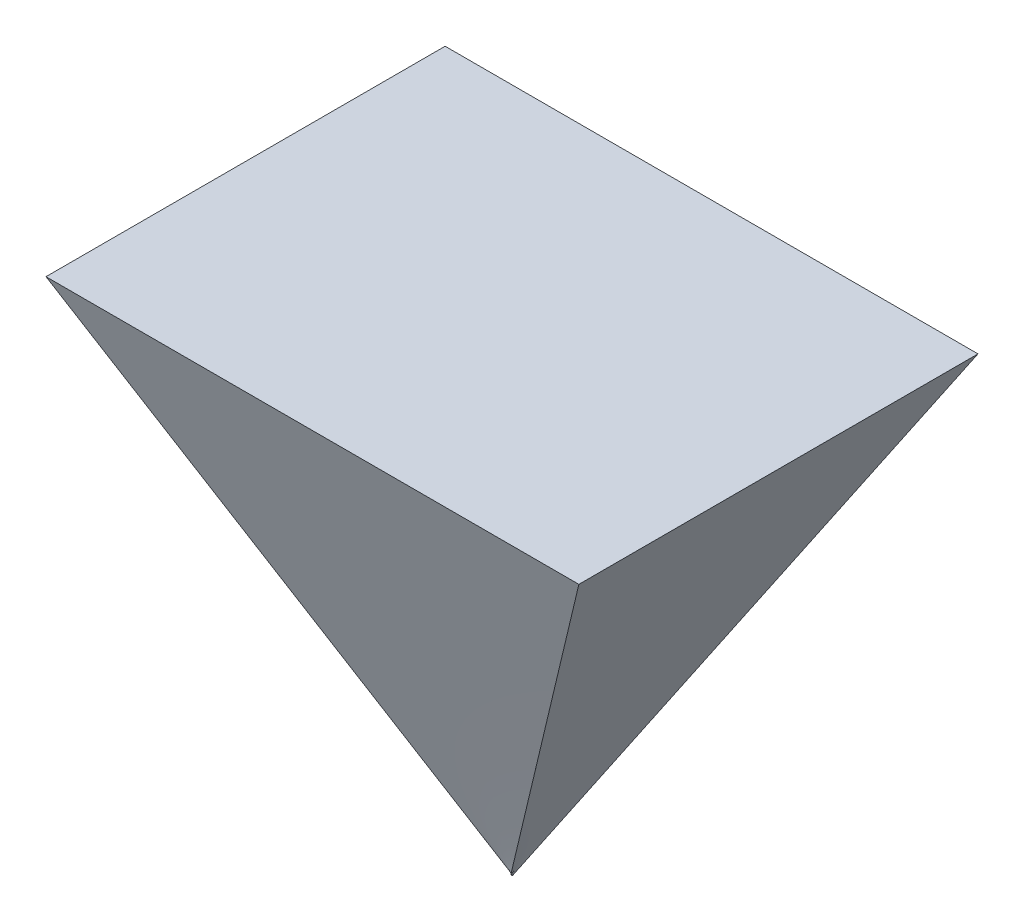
ISO-10303-21;
HEADER;
FILE_DESCRIPTION(('STEP AP214'),'2;1');
FILE_NAME('part.step','',(''),(''),'','','');
FILE_SCHEMA(('AUTOMOTIVE_DESIGN { 1 0 10303 214 1 1 1 1 }'));
ENDSEC;
DATA;
#1=APPLICATION_CONTEXT('core data for automotive mechanical design processes');
#2=APPLICATION_PROTOCOL_DEFINITION('international standard','automotive_design',2000,#1);
#3=PRODUCT_CONTEXT('',#1,'mechanical');
#4=PRODUCT('Part','Part','',(#3));
#5=PRODUCT_RELATED_PRODUCT_CATEGORY('part','',(#4));
#6=PRODUCT_DEFINITION_FORMATION('','',#4);
#7=PRODUCT_DEFINITION_CONTEXT('part definition',#1,'design');
#8=PRODUCT_DEFINITION('design','',#6,#7);
#9=PRODUCT_DEFINITION_SHAPE('','',#8);
#10=(LENGTH_UNIT() NAMED_UNIT(*) SI_UNIT(.MILLI.,.METRE.));
#11=(NAMED_UNIT(*) PLANE_ANGLE_UNIT() SI_UNIT($,.RADIAN.));
#12=(NAMED_UNIT(*) SI_UNIT($,.STERADIAN.) SOLID_ANGLE_UNIT());
#13=UNCERTAINTY_MEASURE_WITH_UNIT(LENGTH_MEASURE(1.E-05),#10,'distance_accuracy_value','');
#14=(GEOMETRIC_REPRESENTATION_CONTEXT(3) GLOBAL_UNCERTAINTY_ASSIGNED_CONTEXT((#13)) GLOBAL_UNIT_ASSIGNED_CONTEXT((#10,
#11,#12)) REPRESENTATION_CONTEXT('',''));
#15=CARTESIAN_POINT('',(0.,0.,0.));
#16=DIRECTION('',(0.,0.,1.));
#17=DIRECTION('',(1.,0.,0.));
#18=AXIS2_PLACEMENT_3D('',#15,#16,#17);
#19=CARTESIAN_POINT('',(6.477,0.,5.334));
#20=CARTESIAN_POINT('',(-1943.1,4978.4,1498.6));
#21=CARTESIAN_POINT('',(6.477,0.,3.56023333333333));
#22=CARTESIAN_POINT('',(-1295.4,4978.4,1498.6));
#23=CARTESIAN_POINT('',(6.477,0.,1.78646666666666));
#24=CARTESIAN_POINT('',(-647.699999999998,4978.4,1498.6));
#25=CARTESIAN_POINT('',(6.477,0.,-1.76106666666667));
#26=CARTESIAN_POINT('',(647.700000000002,4978.4,1498.6));
#27=CARTESIAN_POINT('',(6.477,0.,-3.53483333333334));
#28=CARTESIAN_POINT('',(1295.4,4978.4,1498.6));
#29=CARTESIAN_POINT('',(6.477,0.,-5.3086));
#30=CARTESIAN_POINT('',(1943.1,4978.4,1498.6));
#31=B_SPLINE_SURFACE_WITH_KNOTS('',3,1,((#19,#20),(#21,#22),(#23,#24),(#25,#26),(#27,#28),(#29,
#30)),.UNSPECIFIED.,.F.,.F.,.F.,(4,2,4),(2,2),(0.,0.5,1.),(0.,1.),.UNSPECIFIED.);
#32=CARTESIAN_POINT('',(-18.7542077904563,64.4298967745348,24.659681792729));
#33=CARTESIAN_POINT('',(-18.3913957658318,63.8018862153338,24.4469011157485));
#34=CARTESIAN_POINT('',(-18.0327087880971,63.171611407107,24.2337601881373));
#35=CARTESIAN_POINT('',(-17.3237769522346,61.9064748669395,23.8068451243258));
#36=CARTESIAN_POINT('',(-16.9735327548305,61.2716127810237,23.5930709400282));
#37=CARTESIAN_POINT('',(-16.2817216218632,59.9973162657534,23.1650014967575));
#38=CARTESIAN_POINT('',(-15.9401550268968,59.3578816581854,22.9507062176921));
#39=CARTESIAN_POINT('',(-15.2659330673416,58.0744512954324,22.5217256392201));
#40=CARTESIAN_POINT('',(-14.933277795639,57.4304554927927,22.3070403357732));
#41=CARTESIAN_POINT('',(-14.2771100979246,56.1379088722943,21.877427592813));
#42=CARTESIAN_POINT('',(-13.9535975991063,55.4893580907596,21.6625001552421));
#43=CARTESIAN_POINT('',(-13.317883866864,54.1916597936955,21.2338801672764));
#44=CARTESIAN_POINT('',(-13.0056256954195,53.542540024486,21.020188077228));
#45=CARTESIAN_POINT('',(-12.3905909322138,52.2397938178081,20.5929243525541));
#46=CARTESIAN_POINT('',(-12.0878142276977,51.5861674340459,20.3793527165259));
#47=CARTESIAN_POINT('',(-11.4919629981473,50.2743921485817,19.9525529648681));
#48=CARTESIAN_POINT('',(-11.198888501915,49.6162432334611,19.73932485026));
#49=CARTESIAN_POINT('',(-10.6226596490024,48.2953957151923,19.3134732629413));
#50=CARTESIAN_POINT('',(-10.3395055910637,47.6326969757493,19.1008498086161));
#51=CARTESIAN_POINT('',(-9.78333290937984,46.3027087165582,18.676516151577));
#52=CARTESIAN_POINT('',(-9.51031500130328,45.6354188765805,18.4648060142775));
#53=CARTESIAN_POINT('',(-8.96831826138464,44.280417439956,18.037695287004));
#54=CARTESIAN_POINT('',(-8.69958815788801,43.5925964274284,17.8223260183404));
#55=CARTESIAN_POINT('',(-8.17324079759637,42.2121196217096,17.3934448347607));
#56=CARTESIAN_POINT('',(-7.91562378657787,41.5194637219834,17.179932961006));
#57=CARTESIAN_POINT('',(-7.41176039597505,40.1293181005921,16.7553858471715));
#58=CARTESIAN_POINT('',(-7.16551340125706,39.4318286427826,16.5443504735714));
#59=CARTESIAN_POINT('',(-6.6846363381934,38.0319789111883,16.1255143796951));
#60=CARTESIAN_POINT('',(-6.45000502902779,37.3296191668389,15.9177133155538));
#61=CARTESIAN_POINT('',(-5.99259341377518,35.9199401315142,15.5062890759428));
#62=CARTESIAN_POINT('',(-5.76981157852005,35.2126214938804,15.3026653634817));
#63=CARTESIAN_POINT('',(-5.33493391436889,33.7883247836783,14.8995038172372));
#64=CARTESIAN_POINT('',(-5.12291402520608,33.071313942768,14.6999996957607));
#65=CARTESIAN_POINT('',(-4.71130727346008,31.6318237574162,14.3080024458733));
#66=CARTESIAN_POINT('',(-4.51172040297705,30.9093444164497,14.1155093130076));
#67=CARTESIAN_POINT('',(-4.12518327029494,29.4585306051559,13.7396164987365));
#68=CARTESIAN_POINT('',(-3.93823467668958,28.7301953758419,13.5562180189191));
#69=CARTESIAN_POINT('',(-3.66745660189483,27.6329670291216,13.2901290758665));
#70=CARTESIAN_POINT('',(-3.57878677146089,27.2663577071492,13.2029165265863));
#71=CARTESIAN_POINT('',(-3.40470720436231,26.5315546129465,13.0319927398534));
#72=CARTESIAN_POINT('',(-3.3192974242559,26.1633608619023,12.9482814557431));
#73=CARTESIAN_POINT('',(-3.15169130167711,25.4249850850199,12.7848326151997));
#74=CARTESIAN_POINT('',(-3.0694980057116,25.0548015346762,12.7050988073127));
#75=CARTESIAN_POINT('',(-2.90843860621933,24.3127020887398,12.5503942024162));
#76=CARTESIAN_POINT('',(-2.82957265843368,23.9407861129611,12.4754236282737));
#77=CARTESIAN_POINT('',(-2.75238930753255,23.5679799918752,12.4031915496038));
#78=B_SPLINE_CURVE_WITH_KNOTS('',3,(#32,#33,#34,#35,#36,#37,#38,#39,#40,#41,#42,#43,#44,#45,#46,
#47,#48,#49,#50,#51,#52,#53,#54,#55,#56,#57,#58,#59,#60,#61,#62,#63,#64,#65,#66,#67,#68,#69,#70,
#71,#72,#73,#74,#75,#76,#77),.UNSPECIFIED.,.F.,.F.,(4,2,2,2,2,2,2,2,2,2,2,2,2,2,2,2,2,2,2,2,2,2,
4),(0.,2.26753169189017,4.5352402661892,6.80303771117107,9.07085878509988,11.3386617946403,
13.5926382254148,15.8465878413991,18.1005441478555,20.3545682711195,22.6087512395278,
24.9163119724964,27.2239237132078,29.531410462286,31.8386501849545,34.1455914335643,
36.4670280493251,38.7884631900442,41.1102042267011,42.271571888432,43.4329240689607,
44.5953508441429,45.7578319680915),.UNSPECIFIED.);
#79=CARTESIAN_POINT('',(-18.7542077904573,64.4298967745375,24.6596817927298));
#80=VERTEX_POINT('',#79);
#81=CARTESIAN_POINT('',(-2.75238930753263,23.5679799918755,12.4031915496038));
#82=VERTEX_POINT('',#81);
#83=EDGE_CURVE('E318',#80,#82,#78,.T.);
#84=DIRECTION('',(0.351202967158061,-0.896824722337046,-0.269001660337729));
#85=VECTOR('',#84,1.);
#86=CARTESIAN_POINT('',(-968.311499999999,2489.2,751.967));
#87=LINE('',#86,#85);
#88=EDGE_CURVE('E376',#80,#82,#87,.T.);
#89=ORIENTED_EDGE('',*,*,#83,.F.);
#90=ORIENTED_EDGE('',*,*,#88,.T.);
#91=EDGE_LOOP('',(#89,#90));
#92=FACE_BOUND('',#91,.T.);
#93=ADVANCED_FACE('F57',(#92),#31,.T.);
#94=CARTESIAN_POINT('',(-6.477,0.,5.334));
#95=CARTESIAN_POINT('',(-1943.1,4978.4,-1498.6));
#96=CARTESIAN_POINT('',(-4.318,0.,5.334));
#97=CARTESIAN_POINT('',(-1943.1,4978.4,-999.066666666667));
#98=CARTESIAN_POINT('',(-2.159,0.,5.334));
#99=CARTESIAN_POINT('',(-1943.1,4978.4,-499.533333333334));
#100=CARTESIAN_POINT('',(2.159,0.,5.334));
#101=CARTESIAN_POINT('',(-1943.1,4978.4,499.533333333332));
#102=CARTESIAN_POINT('',(4.318,0.,5.334));
#103=CARTESIAN_POINT('',(-1943.1,4978.4,999.066666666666));
#104=CARTESIAN_POINT('',(6.477,0.,5.334));
#105=CARTESIAN_POINT('',(-1943.1,4978.4,1498.6));
#106=B_SPLINE_SURFACE_WITH_KNOTS('',3,1,((#94,#95),(#96,#97),(#98,#99),(#100,#101),(#102,#103),
(#104,#105)),.UNSPECIFIED.,.F.,.F.,.F.,(4,2,4),(2,2),(0.,0.5,1.),(0.,1.),.UNSPECIFIED.);
#107=CARTESIAN_POINT('',(-2.75238930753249,23.5679799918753,12.4031915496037));
#108=CARTESIAN_POINT('',(-2.89602047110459,23.7707880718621,12.3933432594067));
#109=CARTESIAN_POINT('',(-3.03514362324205,23.9769073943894,12.3890714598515));
#110=CARTESIAN_POINT('',(-3.30446759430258,24.3931286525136,12.3903875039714));
#111=CARTESIAN_POINT('',(-3.43471704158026,24.6031991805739,12.3959162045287));
#112=CARTESIAN_POINT('',(-3.68770215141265,25.0265018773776,12.4154225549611));
#113=CARTESIAN_POINT('',(-3.81045975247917,25.2397222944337,12.4293740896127));
#114=CARTESIAN_POINT('',(-4.04966284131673,25.6687188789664,12.4645399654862));
#115=CARTESIAN_POINT('',(-4.16611592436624,25.884491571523,12.4857453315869));
#116=CARTESIAN_POINT('',(-4.39370038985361,26.3180695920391,12.5344171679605));
#117=CARTESIAN_POINT('',(-4.50483251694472,26.5358746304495,12.5618827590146));
#118=CARTESIAN_POINT('',(-4.72180370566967,26.9714939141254,12.6220108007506));
#119=CARTESIAN_POINT('',(-4.82767381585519,27.1892978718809,12.6546363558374));
#120=CARTESIAN_POINT('',(-5.03567409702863,27.626190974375,12.7245365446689));
#121=CARTESIAN_POINT('',(-5.1378006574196,27.8452811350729,12.761815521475));
#122=CARTESIAN_POINT('',(-5.33885609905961,28.2844333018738,12.8404298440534));
#123=CARTESIAN_POINT('',(-5.43778208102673,28.5044959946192,12.8817687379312));
#124=CARTESIAN_POINT('',(-5.63287987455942,28.9453083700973,12.9679923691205));
#125=CARTESIAN_POINT('',(-5.72904996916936,29.1660583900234,13.0128792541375));
#126=CARTESIAN_POINT('',(-5.9189957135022,29.6079832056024,13.1057576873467));
#127=CARTESIAN_POINT('',(-6.01277089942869,29.8291580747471,13.153749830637));
#128=CARTESIAN_POINT('',(-6.26183997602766,30.4234746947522,13.2862990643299));
#129=CARTESIAN_POINT('',(-6.41523651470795,30.7968517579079,13.3733683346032));
#130=CARTESIAN_POINT('',(-6.71750721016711,31.5439097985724,13.5538575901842));
#131=CARTESIAN_POINT('',(-6.86638111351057,31.9175907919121,13.6472779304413));
#132=CARTESIAN_POINT('',(-7.16053250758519,32.6648096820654,13.8393575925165));
#133=CARTESIAN_POINT('',(-7.305811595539,33.0383475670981,13.9380145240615));
#134=CARTESIAN_POINT('',(-7.59361232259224,33.7852882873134,14.1397757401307));
#135=CARTESIAN_POINT('',(-7.73613390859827,34.1586911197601,14.2428801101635));
#136=CARTESIAN_POINT('',(-8.01904277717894,34.9053397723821,14.4529019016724));
#137=CARTESIAN_POINT('',(-8.15942953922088,35.2785855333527,14.5598202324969));
#138=CARTESIAN_POINT('',(-8.43849101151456,36.0247681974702,14.7769238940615));
#139=CARTESIAN_POINT('',(-8.57716570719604,36.3977050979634,14.8871092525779));
#140=CARTESIAN_POINT('',(-8.99127111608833,37.5162293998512,15.2219757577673));
#141=CARTESIAN_POINT('',(-9.26469292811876,38.2612908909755,15.4508993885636));
#142=CARTESIAN_POINT('',(-9.80827996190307,39.7500055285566,15.9175113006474));
#143=CARTESIAN_POINT('',(-10.0784445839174,40.4936583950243,16.1552011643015));
#144=CARTESIAN_POINT('',(-10.616730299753,41.9793917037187,16.6375154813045));
#145=CARTESIAN_POINT('',(-10.8848515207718,42.7214722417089,16.882139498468));
#146=CARTESIAN_POINT('',(-11.4224713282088,44.2112640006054,17.3793992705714));
#147=CARTESIAN_POINT('',(-11.6919585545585,44.9589611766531,17.6320892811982));
#148=CARTESIAN_POINT('',(-12.2302019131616,46.4526839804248,18.1421283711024));
#149=CARTESIAN_POINT('',(-12.4989582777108,47.1987101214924,18.3994757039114));
#150=CARTESIAN_POINT('',(-13.0361553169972,48.6892831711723,18.9180908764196));
#151=CARTESIAN_POINT('',(-13.3045960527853,49.4338303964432,19.1793577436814));
#152=CARTESIAN_POINT('',(-13.841446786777,50.9216259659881,19.7052398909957));
#153=CARTESIAN_POINT('',(-14.1098567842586,51.6648744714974,19.9698547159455));
#154=CARTESIAN_POINT('',(-14.6468438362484,53.1502411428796,20.5019823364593));
#155=CARTESIAN_POINT('',(-14.9154208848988,53.8923593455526,20.7694950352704));
#156=CARTESIAN_POINT('',(-15.4528809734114,55.3756233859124,21.3070585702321));
#157=CARTESIAN_POINT('',(-15.7217640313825,56.1167691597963,21.5771095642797));
#158=CARTESIAN_POINT('',(-16.1059641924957,57.1743906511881,21.9642947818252));
#159=CARTESIAN_POINT('',(-16.2211335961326,57.491250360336,22.0805276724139));
#160=CARTESIAN_POINT('',(-16.4515483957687,58.1248198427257,22.3133825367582));
#161=CARTESIAN_POINT('',(-16.5667937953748,58.4415296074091,22.4300045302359));
#162=CARTESIAN_POINT('',(-16.7973620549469,59.0747994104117,22.6636154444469));
#163=CARTESIAN_POINT('',(-16.9126849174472,59.3913594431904,22.7806043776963));
#164=CARTESIAN_POINT('',(-17.1434087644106,60.0243297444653,23.0149286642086));
#165=CARTESIAN_POINT('',(-17.2588097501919,60.3407400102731,23.1322640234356));
#166=CARTESIAN_POINT('',(-17.4890930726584,60.9717749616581,23.3666543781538));
#167=CARTESIAN_POINT('',(-17.6039750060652,61.2864004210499,23.4837076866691));
#168=CARTESIAN_POINT('',(-17.833815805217,61.9155022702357,23.718120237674));
#169=CARTESIAN_POINT('',(-17.948774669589,62.2299786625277,23.8354794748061));
#170=CARTESIAN_POINT('',(-18.1787684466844,62.8587816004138,24.0704870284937));
#171=CARTESIAN_POINT('',(-18.2938033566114,63.1731081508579,24.1881353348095));
#172=CARTESIAN_POINT('',(-18.5239478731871,63.8016103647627,24.4237053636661));
#173=CARTESIAN_POINT('',(-18.639057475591,64.1157860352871,24.5416270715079));
#174=CARTESIAN_POINT('',(-18.7542077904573,64.4298967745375,24.6596817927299));
#175=B_SPLINE_CURVE_WITH_KNOTS('',3,(#107,#108,#109,#110,#111,#112,#113,#114,#115,#116,#117,
#118,#119,#120,#121,#122,#123,#124,#125,#126,#127,#128,#129,#130,#131,#132,#133,#134,#135,#136,
#137,#138,#139,#140,#141,#142,#143,#144,#145,#146,#147,#148,#149,#150,#151,#152,#153,#154,#155,
#156,#157,#158,#159,#160,#161,#162,#163,#164,#165,#166,#167,#168,#169,#170,#171,#172,#173,#174),
.UNSPECIFIED.,.F.,.F.,(4,2,2,2,2,2,2,2,2,2,2,2,2,2,2,2,2,2,2,2,2,2,2,2,2,2,2,2,2,2,2,2,2,4),(0.,
0.745833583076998,1.48718159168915,2.2262427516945,2.96439276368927,3.70243916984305,
4.43542885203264,5.16910782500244,5.90343379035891,6.63820772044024,7.37312288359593,
8.6118498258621,9.8506460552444,11.0888816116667,12.3271409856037,13.5656975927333,
14.8042647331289,17.2821933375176,19.7605714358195,22.2387939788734,24.7407236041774,
27.241733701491,29.7421332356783,32.2421964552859,34.7421764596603,37.2423130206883,
38.3121573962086,39.3820568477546,40.4519931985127,41.521948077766,42.5863710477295,
43.6507755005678,44.7151427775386,45.7794540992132),.UNSPECIFIED.);
#176=EDGE_CURVE('E313',#82,#80,#175,.T.);
#177=ORIENTED_EDGE('',*,*,#176,.F.);
#178=ORIENTED_EDGE('',*,*,#88,.F.);
#179=EDGE_LOOP('',(#177,#178));
#180=FACE_BOUND('',#179,.T.);
#181=ADVANCED_FACE('F279',(#180),#106,.T.);
#182=CARTESIAN_POINT('',(-8.48172111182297,0.,-6.34779935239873));
#183=CARTESIAN_POINT('',(-2738.82995661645,4978.4,2050.));
#184=CARTESIAN_POINT('',(-8.48172111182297,0.,-4.25049866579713));
#185=CARTESIAN_POINT('',(-1826.52496384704,4978.4,2050.));
#186=CARTESIAN_POINT('',(-8.48172111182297,0.,-2.15319797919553));
#187=CARTESIAN_POINT('',(-914.219971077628,4978.4,2050.));
#188=CARTESIAN_POINT('',(-8.48172111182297,0.,2.04140339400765));
#189=CARTESIAN_POINT('',(910.39001446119,4978.4,2050.));
#190=CARTESIAN_POINT('',(-8.48172111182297,0.,4.13870408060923));
#191=CARTESIAN_POINT('',(1822.6950072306,4978.4,2050.));
#192=CARTESIAN_POINT('',(-8.48172111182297,0.,6.23600476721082));
#193=CARTESIAN_POINT('',(2735.,4978.4,2050.));
#194=B_SPLINE_SURFACE_WITH_KNOTS('',3,1,((#182,#183),(#184,#185),(#186,#187),(#188,#189),(#190,
#191),(#192,#193)),.UNSPECIFIED.,.F.,.F.,.F.,(4,2,4),(2,2),(0.,0.5,1.),(0.,1.),.UNSPECIFIED.);
#195=CARTESIAN_POINT('',(-7.62953997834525,2.96278884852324,4.43896567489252));
#196=CARTESIAN_POINT('',(-7.63794338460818,3.01386089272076,4.37078549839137));
#197=CARTESIAN_POINT('',(-7.64686498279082,3.06673637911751,4.30400674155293));
#198=CARTESIAN_POINT('',(-7.66582831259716,3.17600055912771,4.17358940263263));
#199=CARTESIAN_POINT('',(-7.67586972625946,3.23238825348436,4.10994993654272));
#200=CARTESIAN_POINT('',(-7.6971587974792,3.34859962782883,3.98612291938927));
#201=CARTESIAN_POINT('',(-7.7084061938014,3.40842256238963,3.92593462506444));
#202=CARTESIAN_POINT('',(-7.73196949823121,3.53025455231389,3.81025796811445));
#203=CARTESIAN_POINT('',(-7.7442634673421,3.59220762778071,3.75470615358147));
#204=CARTESIAN_POINT('',(-7.77012859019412,3.71900385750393,3.6473241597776));
#205=CARTESIAN_POINT('',(-7.78369973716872,3.78384699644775,3.59549396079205));
#206=CARTESIAN_POINT('',(-7.81214522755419,3.91611289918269,3.49563022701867));
#207=CARTESIAN_POINT('',(-7.82701956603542,3.98353565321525,3.44759667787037));
#208=CARTESIAN_POINT('',(-7.86195738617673,4.13773113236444,3.3437982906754));
#209=CARTESIAN_POINT('',(-7.88238974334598,4.22513533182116,3.28909375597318));
#210=CARTESIAN_POINT('',(-7.92529802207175,4.40280760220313,3.18537758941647));
#211=CARTESIAN_POINT('',(-7.94777479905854,4.49307686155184,3.13636836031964));
#212=CARTESIAN_POINT('',(-7.99472621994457,4.67582367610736,3.04371820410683));
#213=CARTESIAN_POINT('',(-8.01920105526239,4.76830144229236,3.00007779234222));
#214=CARTESIAN_POINT('',(-8.0702615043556,4.95552822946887,2.91746434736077));
#215=CARTESIAN_POINT('',(-8.09686025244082,5.05028836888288,2.87852481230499));
#216=CARTESIAN_POINT('',(-8.15195319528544,5.24097653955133,2.8051868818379));
#217=CARTESIAN_POINT('',(-8.18044702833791,5.33690434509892,2.77078762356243));
#218=CARTESIAN_POINT('',(-8.23926520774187,5.52955401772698,2.70605160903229));
#219=CARTESIAN_POINT('',(-8.26958955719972,5.62627588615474,2.6757148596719));
#220=CARTESIAN_POINT('',(-8.37656784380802,5.95863906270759,2.57788329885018));
#221=CARTESIAN_POINT('',(-8.45756307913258,6.19549038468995,2.51916493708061));
#222=CARTESIAN_POINT('',(-8.62920870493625,6.6692686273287,2.41731592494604));
#223=CARTESIAN_POINT('',(-8.71987309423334,6.90619514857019,2.37420828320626));
#224=CARTESIAN_POINT('',(-8.9101171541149,7.37845871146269,2.29958339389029));
#225=CARTESIAN_POINT('',(-9.00970352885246,7.61379441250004,2.26807495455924));
#226=CARTESIAN_POINT('',(-9.21733610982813,8.08236314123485,2.21370783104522));
#227=CARTESIAN_POINT('',(-9.32540212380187,8.31558973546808,2.19087017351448));
#228=CARTESIAN_POINT('',(-9.5491034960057,8.77866306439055,2.15186087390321));
#229=CARTESIAN_POINT('',(-9.66473181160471,9.00851270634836,2.13568312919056));
#230=CARTESIAN_POINT('',(-9.90308989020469,9.46471722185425,2.10844483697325));
#231=CARTESIAN_POINT('',(-10.0258177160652,9.69107302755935,2.09738290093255));
#232=CARTESIAN_POINT('',(-10.2389323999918,10.0707524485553,2.08205545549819));
#233=CARTESIAN_POINT('',(-10.3275837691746,10.2250139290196,2.07674606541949));
#234=CARTESIAN_POINT('',(-10.5075262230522,10.5311578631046,2.06777658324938));
#235=CARTESIAN_POINT('',(-10.598804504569,10.6830476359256,2.06410958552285));
#236=CARTESIAN_POINT('',(-10.6915096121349,10.834072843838,2.06111503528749));
#237=B_SPLINE_CURVE_WITH_KNOTS('',3,(#195,#196,#197,#198,#199,#200,#201,#202,#203,#204,#205,
#206,#207,#208,#209,#210,#211,#212,#213,#214,#215,#216,#217,#218,#219,#220,#221,#222,#223,#224,
#225,#226,#227,#228,#229,#230,#231,#232,#233,#234,#235,#236),.UNSPECIFIED.,.F.,.F.,(4,2,2,2,2,2,
2,2,2,2,2,2,2,2,2,2,2,2,2,2,4),(0.,0.25678665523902,0.513500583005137,0.770159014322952,
1.02236185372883,1.27456335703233,1.52676390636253,1.84187543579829,2.15711942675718,
2.47239365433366,2.78979628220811,3.10713850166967,3.42448125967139,4.19483518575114,
4.96631995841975,5.7383893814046,6.51231929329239,7.28553844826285,8.05854761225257,
8.59250744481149,9.12420060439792),.UNSPECIFIED.);
#238=CARTESIAN_POINT('',(-7.62953997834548,2.96278884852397,4.43896567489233));
#239=VERTEX_POINT('',#238);
#240=CARTESIAN_POINT('',(-10.691509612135,10.834072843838,2.0611150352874));
#241=VERTEX_POINT('',#240);
#242=EDGE_CURVE('E68',#239,#241,#237,.T.);
#243=CARTESIAN_POINT('',(-10.6915096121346,10.8340728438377,2.06111503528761));
#244=CARTESIAN_POINT('',(-10.5842502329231,10.7536904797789,2.12375358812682));
#245=CARTESIAN_POINT('',(-10.4784557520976,10.6702968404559,2.18509686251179));
#246=CARTESIAN_POINT('',(-10.2702766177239,10.4972752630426,2.30502634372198));
#247=CARTESIAN_POINT('',(-10.1678951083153,10.4076417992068,2.3636100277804));
#248=CARTESIAN_POINT('',(-9.96719791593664,10.2220554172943,2.47775118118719));
#249=CARTESIAN_POINT('',(-9.86888298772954,10.1261013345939,2.53330808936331));
#250=CARTESIAN_POINT('',(-9.67765573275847,9.92866008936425,2.64081131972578));
#251=CARTESIAN_POINT('',(-9.5847082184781,9.82722017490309,2.69278173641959));
#252=CARTESIAN_POINT('',(-9.40400051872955,9.61833686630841,2.79345615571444));
#253=CARTESIAN_POINT('',(-9.31623873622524,9.51089534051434,2.84216116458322));
#254=CARTESIAN_POINT('',(-9.14638255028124,9.29028444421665,2.93630188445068));
#255=CARTESIAN_POINT('',(-9.06428722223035,9.1771160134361,2.9817381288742));
#256=CARTESIAN_POINT('',(-8.90584825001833,8.94497372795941,3.06960338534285));
#257=CARTESIAN_POINT('',(-8.82952883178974,8.82597853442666,3.11201969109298));
#258=CARTESIAN_POINT('',(-8.68331194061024,8.58307061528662,3.19382456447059));
#259=CARTESIAN_POINT('',(-8.6134157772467,8.4591568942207,3.23321251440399));
#260=CARTESIAN_POINT('',(-8.48028139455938,8.20698158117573,3.30920570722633));
#261=CARTESIAN_POINT('',(-8.41704316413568,8.07871999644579,3.34581095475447));
#262=CARTESIAN_POINT('',(-8.2972265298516,7.81815181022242,3.41663243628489));
#263=CARTESIAN_POINT('',(-8.24066193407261,7.68583751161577,3.45084365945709));
#264=CARTESIAN_POINT('',(-8.13438808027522,7.4179772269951,3.51716782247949));
#265=CARTESIAN_POINT('',(-8.08467864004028,7.28243132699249,3.54928081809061));
#266=CARTESIAN_POINT('',(-7.992099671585,7.00864514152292,3.61181194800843));
#267=CARTESIAN_POINT('',(-7.94923060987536,6.87040467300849,3.64222996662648));
#268=CARTESIAN_POINT('',(-7.83595080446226,6.47053128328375,3.72769381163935));
#269=CARTESIAN_POINT('',(-7.77400171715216,6.20611971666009,3.78115727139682));
#270=CARTESIAN_POINT('',(-7.67335605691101,5.67253909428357,3.88635673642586));
#271=CARTESIAN_POINT('',(-7.63466855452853,5.40336822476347,3.93809206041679));
#272=CARTESIAN_POINT('',(-7.58010735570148,4.86320625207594,4.04232362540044));
#273=CARTESIAN_POINT('',(-7.56420785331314,4.59221755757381,4.09481893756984));
#274=CARTESIAN_POINT('',(-7.55477394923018,4.05060988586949,4.20289105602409));
#275=CARTESIAN_POINT('',(-7.56122463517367,3.77999078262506,4.25846578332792));
#276=CARTESIAN_POINT('',(-7.58461304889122,3.41896506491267,4.33634019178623));
#277=CARTESIAN_POINT('',(-7.59183269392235,3.32737625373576,4.35642105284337));
#278=CARTESIAN_POINT('',(-7.60879787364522,3.14471319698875,4.39720421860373));
#279=CARTESIAN_POINT('',(-7.6185397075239,3.05363839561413,4.41790557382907));
#280=CARTESIAN_POINT('',(-7.62953997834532,2.9627888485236,4.43896567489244));
#281=B_SPLINE_CURVE_WITH_KNOTS('',3,(#243,#244,#245,#246,#247,#248,#249,#250,#251,#252,#253,
#254,#255,#256,#257,#258,#259,#260,#261,#262,#263,#264,#265,#266,#267,#268,#269,#270,#271,#272,
#273,#274,#275,#276,#277,#278,#279,#280),.UNSPECIFIED.,.F.,.F.,(4,2,2,2,2,2,2,2,2,2,2,2,2,2,2,2,
2,2,4),(0.,0.443847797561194,0.888093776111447,1.33242184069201,1.77339499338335,
2.21423162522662,2.65499615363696,3.09751725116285,3.54012837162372,3.98273875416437,
4.42624942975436,4.86974831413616,5.31327743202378,6.14244418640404,6.97193405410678,
7.80048383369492,8.62848089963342,8.91057886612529,9.19226523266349),.UNSPECIFIED.);
#282=EDGE_CURVE('E306',#241,#239,#281,.T.);
#283=DIRECTION('',(0.,0.,1.));
#284=VECTOR('',#283,1.);
#285=CARTESIAN_POINT('',(-8.48172111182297,0.,-6.34779935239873));
#286=LINE('',#285,#284);
#287=CARTESIAN_POINT('',(-8.48172111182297,0.,-6.34779935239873));
#288=VERTEX_POINT('',#287);
#289=CARTESIAN_POINT('',(-8.48172111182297,0.,6.23600476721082));
#290=VERTEX_POINT('',#289);
#291=EDGE_CURVE('E149',#288,#290,#286,.T.);
#292=DIRECTION('',(0.454178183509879,0.824164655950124,0.33834124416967));
#293=VECTOR('',#292,1.);
#294=CARTESIAN_POINT('',(1363.25913944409,2489.2,1028.11800238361));
#295=LINE('',#294,#293);
#296=CARTESIAN_POINT('',(2735.,4978.4,2050.));
#297=VERTEX_POINT('',#296);
#298=EDGE_CURVE('E156',#290,#297,#295,.T.);
#299=DIRECTION('',(1.,0.,0.));
#300=VECTOR('',#299,1.);
#301=CARTESIAN_POINT('',(2735.,4978.4,2050.));
#302=LINE('',#301,#300);
#303=CARTESIAN_POINT('',(-2738.82995661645,4978.4,2050.));
#304=VERTEX_POINT('',#303);
#305=EDGE_CURVE('E152',#304,#297,#302,.T.);
#306=DIRECTION('',(0.452129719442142,-0.824393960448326,-0.340519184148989));
#307=VECTOR('',#306,1.);
#308=CARTESIAN_POINT('',(-1373.65583886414,2489.2,1021.8261003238));
#309=LINE('',#308,#307);
#310=EDGE_CURVE('E144',#304,#288,#309,.T.);
#311=ORIENTED_EDGE('',*,*,#176,.T.);
#312=ORIENTED_EDGE('',*,*,#83,.T.);
#313=EDGE_LOOP('',(#311,#312));
#314=FACE_BOUND('',#313,.T.);
#315=ORIENTED_EDGE('',*,*,#242,.T.);
#316=ORIENTED_EDGE('',*,*,#282,.T.);
#317=EDGE_LOOP('',(#315,#316));
#318=FACE_BOUND('',#317,.T.);
#319=ORIENTED_EDGE('',*,*,#291,.T.);
#320=ORIENTED_EDGE('',*,*,#298,.T.);
#321=ORIENTED_EDGE('',*,*,#305,.F.);
#322=ORIENTED_EDGE('',*,*,#310,.T.);
#323=EDGE_LOOP('',(#319,#320,#321,#322));
#324=FACE_BOUND('',#323,.T.);
#325=ADVANCED_FACE('F146',(#314,#318,#324),#194,.T.);
#326=CARTESIAN_POINT('',(-8.48172111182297,0.,6.23600476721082));
#327=CARTESIAN_POINT('',(2735.,4978.4,2050.));
#328=CARTESIAN_POINT('',(-5.81640148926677,0.,6.23600476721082));
#329=CARTESIAN_POINT('',(2735.,4978.4,1366.66666666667));
#330=CARTESIAN_POINT('',(-3.15108186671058,0.,6.23600476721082));
#331=CARTESIAN_POINT('',(2735.,4978.4,683.333333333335));
#332=CARTESIAN_POINT('',(2.1795573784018,0.,6.23600476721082));
#333=CARTESIAN_POINT('',(2735.,4978.4,-683.333333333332));
#334=CARTESIAN_POINT('',(4.84487700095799,0.,6.23600476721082));
#335=CARTESIAN_POINT('',(2735.,4978.4,-1366.66666666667));
#336=CARTESIAN_POINT('',(7.51019662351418,0.,6.23600476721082));
#337=CARTESIAN_POINT('',(2735.,4978.4,-2050.));
#338=B_SPLINE_SURFACE_WITH_KNOTS('',3,1,((#326,#327),(#328,#329),(#330,#331),(#332,#333),(#334,
#335),(#336,#337)),.UNSPECIFIED.,.F.,.F.,.F.,(4,2,4),(2,2),(0.,0.5,1.),(0.,1.),.UNSPECIFIED.);
#339=CARTESIAN_POINT('',(27.5639723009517,54.2074440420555,11.0667497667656));
#340=CARTESIAN_POINT('',(27.2329557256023,53.4444731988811,10.7490753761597));
#341=CARTESIAN_POINT('',(26.9020946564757,52.6789527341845,10.4373501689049));
#342=CARTESIAN_POINT('',(26.241598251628,51.1438131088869,9.82646409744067));
#343=CARTESIAN_POINT('',(25.9119618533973,50.374201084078,9.52728644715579));
#344=CARTESIAN_POINT('',(25.2542952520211,48.8306697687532,8.94162326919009));
#345=CARTESIAN_POINT('',(24.9262636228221,48.0567565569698,8.65512332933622));
#346=CARTESIAN_POINT('',(24.2723018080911,46.5043687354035,8.09494509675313));
#347=CARTESIAN_POINT('',(23.9463699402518,45.7258990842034,7.82125503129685));
#348=CARTESIAN_POINT('',(23.2972193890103,44.1640931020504,7.28682857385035));
#349=CARTESIAN_POINT('',(22.9739989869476,43.3807605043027,7.02608336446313));
#350=CARTESIAN_POINT('',(22.3310466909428,41.8088533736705,6.51768077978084));
#351=CARTESIAN_POINT('',(22.0113133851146,41.0202811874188,6.27001793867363));
#352=CARTESIAN_POINT('',(21.3761298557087,39.4369275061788,5.78776440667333));
#353=CARTESIAN_POINT('',(21.0606818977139,38.6421430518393,5.55318044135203));
#354=CARTESIAN_POINT('',(20.4355836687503,37.0462819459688,5.09739828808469));
#355=CARTESIAN_POINT('',(20.1259345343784,36.2452041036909,4.87620270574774));
#356=CARTESIAN_POINT('',(19.514206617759,34.6360776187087,4.44736227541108));
#357=CARTESIAN_POINT('',(19.2121315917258,33.8280257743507,4.23972407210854));
#358=CARTESIAN_POINT('',(18.6179368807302,32.2040269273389,3.83815950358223));
#359=CARTESIAN_POINT('',(18.3258259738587,31.3880737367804,3.64424507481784));
#360=CARTESIAN_POINT('',(17.8977841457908,30.1575708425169,3.36384790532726));
#361=CARTESIAN_POINT('',(17.7566949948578,29.7460149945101,3.27206687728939));
#362=CARTESIAN_POINT('',(17.4785608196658,28.9207644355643,3.09207880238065));
#363=CARTESIAN_POINT('',(17.341515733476,28.5070697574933,3.00387170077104));
#364=CARTESIAN_POINT('',(17.0718491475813,27.6764751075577,2.8308699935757));
#365=CARTESIAN_POINT('',(16.9392380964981,27.2595700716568,2.74608336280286));
#366=CARTESIAN_POINT('',(16.6796509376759,26.4232637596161,2.58015858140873));
#367=CARTESIAN_POINT('',(16.5526751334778,26.0038623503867,2.49902062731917));
#368=CARTESIAN_POINT('',(16.4289705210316,25.5831362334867,2.41972608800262));
#369=B_SPLINE_CURVE_WITH_KNOTS('',3,(#339,#340,#341,#342,#343,#344,#345,#346,#347,#348,#349,
#350,#351,#352,#353,#354,#355,#356,#357,#358,#359,#360,#361,#362,#363,#364,#365,#366,#367,#368),
.UNSPECIFIED.,.F.,.F.,(4,2,2,2,2,2,2,2,2,2,2,2,2,2,4),(0.,2.67084824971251,5.33800138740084,
8.00204019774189,10.6635805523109,13.3232823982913,15.9818640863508,18.6418005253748,
21.3022529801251,23.96399972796,26.628033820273,27.9619344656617,29.2958146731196,
30.6326435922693,31.9695444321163),.UNSPECIFIED.);
#370=CARTESIAN_POINT('',(27.5639723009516,54.2074440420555,11.0667497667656));
#371=VERTEX_POINT('',#370);
#372=CARTESIAN_POINT('',(16.4289705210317,25.5831362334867,2.41972608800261));
#373=VERTEX_POINT('',#372);
#374=EDGE_CURVE('E75',#371,#373,#369,.T.);
#375=CARTESIAN_POINT('',(16.4289705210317,25.5831362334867,2.41972608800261));
#376=CARTESIAN_POINT('',(16.4399034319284,25.7081945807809,2.47749882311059));
#377=CARTESIAN_POINT('',(16.4526459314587,25.8335784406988,2.53418621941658));
#378=CARTESIAN_POINT('',(16.4814256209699,26.0848299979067,2.64556426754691));
#379=CARTESIAN_POINT('',(16.4974622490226,26.2106976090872,2.70025525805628));
#380=CARTESIAN_POINT('',(16.5498724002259,26.5876817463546,2.86112930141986));
#381=CARTESIAN_POINT('',(16.5906526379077,26.8393307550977,2.96464054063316));
#382=CARTESIAN_POINT('',(16.6817903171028,27.3426518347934,3.16552125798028));
#383=CARTESIAN_POINT('',(16.7321270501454,27.5943227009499,3.26290342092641));
#384=CARTESIAN_POINT('',(16.8407414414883,28.0975633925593,3.45272977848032));
#385=CARTESIAN_POINT('',(16.899012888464,28.3491331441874,3.54517775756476));
#386=CARTESIAN_POINT('',(17.0222134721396,28.8520563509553,3.72605378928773));
#387=CARTESIAN_POINT('',(17.087142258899,29.1034098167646,3.81448205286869));
#388=CARTESIAN_POINT('',(17.2223486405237,29.6047340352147,3.98766149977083));
#389=CARTESIAN_POINT('',(17.2926037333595,29.8547062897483,4.0724260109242));
#390=CARTESIAN_POINT('',(17.4379170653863,30.3543538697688,4.23926042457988));
#391=CARTESIAN_POINT('',(17.5129785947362,30.6040288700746,4.32132842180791));
#392=CARTESIAN_POINT('',(17.6672434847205,31.1030128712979,4.48320774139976));
#393=CARTESIAN_POINT('',(17.7464494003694,31.3523215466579,4.56301762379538));
#394=CARTESIAN_POINT('',(17.908450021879,31.850497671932,4.72072780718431));
#395=CARTESIAN_POINT('',(17.9912462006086,32.0993648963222,4.79862730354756));
#396=CARTESIAN_POINT('',(18.159959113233,32.5965777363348,4.95279283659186));
#397=CARTESIAN_POINT('',(18.2458761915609,32.844923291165,5.02905869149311));
#398=CARTESIAN_POINT('',(18.4381018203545,33.3912433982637,5.19548278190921));
#399=CARTESIAN_POINT('',(18.5450202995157,33.6890975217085,5.28533132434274));
#400=CARTESIAN_POINT('',(18.7622880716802,34.2840507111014,5.46337096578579));
#401=CARTESIAN_POINT('',(18.8726374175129,34.5811497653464,5.55156203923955));
#402=CARTESIAN_POINT('',(19.2080726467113,35.4711237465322,5.814019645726));
#403=CARTESIAN_POINT('',(19.4376313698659,36.0629167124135,5.98624356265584));
#404=CARTESIAN_POINT('',(19.9060291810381,37.2438623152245,6.32691823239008));
#405=CARTESIAN_POINT('',(20.1448679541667,37.833015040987,6.49536911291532));
#406=CARTESIAN_POINT('',(20.6300306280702,39.0090475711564,6.8296386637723));
#407=CARTESIAN_POINT('',(20.8763552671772,39.5959271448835,6.99545707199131));
#408=CARTESIAN_POINT('',(21.375145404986,40.767678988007,7.32524608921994));
#409=CARTESIAN_POINT('',(21.627611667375,41.3525509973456,7.48921646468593));
#410=CARTESIAN_POINT('',(22.1376632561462,42.5204913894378,7.8158542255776));
#411=CARTESIAN_POINT('',(22.3952490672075,43.1035595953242,7.97852148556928));
#412=CARTESIAN_POINT('',(22.9178146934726,44.274941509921,8.30485893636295));
#413=CARTESIAN_POINT('',(23.1828459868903,44.863235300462,8.46851810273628));
#414=CARTESIAN_POINT('',(23.7166681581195,46.0382579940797,8.79518076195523));
#415=CARTESIAN_POINT('',(23.9854588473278,46.6249869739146,8.95818428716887));
#416=CARTESIAN_POINT('',(24.526245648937,47.7969381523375,9.2837283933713));
#417=CARTESIAN_POINT('',(24.798241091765,48.3821606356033,9.44626906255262));
#418=CARTESIAN_POINT('',(25.3449749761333,49.5511303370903,9.77102085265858));
#419=CARTESIAN_POINT('',(25.6197123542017,50.1348780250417,9.93323207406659));
#420=CARTESIAN_POINT('',(26.1715342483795,51.3009096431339,10.2574171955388));
#421=CARTESIAN_POINT('',(26.4486173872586,51.8831942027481,10.4193911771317));
#422=CARTESIAN_POINT('',(27.0048013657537,53.0462911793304,10.7431565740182));
#423=CARTESIAN_POINT('',(27.2839005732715,53.6271043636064,10.9049480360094));
#424=CARTESIAN_POINT('',(27.5639723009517,54.2074440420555,11.0667497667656));
#425=B_SPLINE_CURVE_WITH_KNOTS('',3,(#375,#376,#377,#378,#379,#380,#381,#382,#383,#384,#385,
#386,#387,#388,#389,#390,#391,#392,#393,#394,#395,#396,#397,#398,#399,#400,#401,#402,#403,#404,
#405,#406,#407,#408,#409,#410,#411,#412,#413,#414,#415,#416,#417,#418,#419,#420,#421,#422,#423,
#424),.UNSPECIFIED.,.F.,.F.,(4,2,2,2,2,2,2,2,2,2,2,2,2,2,2,2,2,2,2,2,2,2,2,2,4),(0.,
0.414531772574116,0.828992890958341,1.65410823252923,2.47745558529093,3.30016208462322,
4.12282536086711,4.94218846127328,5.76211856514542,6.58256025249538,7.40334176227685,
8.22421413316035,9.21109668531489,10.1979944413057,12.1709915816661,14.1439218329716,
16.117047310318,18.0904194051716,20.0639792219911,22.0609720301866,24.0578650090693,
26.0543479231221,28.0500844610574,30.0447209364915,32.0378918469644),.UNSPECIFIED.);
#426=EDGE_CURVE('E356',#373,#371,#425,.T.);
#427=CARTESIAN_POINT('',(5.87334442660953,1.54148254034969,5.79636611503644));
#428=CARTESIAN_POINT('',(5.76720974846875,1.56964498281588,5.79799578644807));
#429=CARTESIAN_POINT('',(5.6614421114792,1.59926233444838,5.79975944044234));
#430=CARTESIAN_POINT('',(5.45050768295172,1.66205021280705,5.80364307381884));
#431=CARTESIAN_POINT('',(5.34534509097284,1.69523471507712,5.80576447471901));
#432=CARTESIAN_POINT('',(5.13620508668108,1.76563040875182,5.81044340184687));
#433=CARTESIAN_POINT('',(5.03222961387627,1.80284736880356,5.81300155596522));
#434=CARTESIAN_POINT('',(4.82379925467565,1.8827452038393,5.81872266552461));
#435=CARTESIAN_POINT('',(4.71938326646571,1.92552744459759,5.82189758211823));
#436=CARTESIAN_POINT('',(4.51311837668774,2.0165524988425,5.82895409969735));
#437=CARTESIAN_POINT('',(4.41126647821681,2.0647885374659,5.832834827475));
#438=CARTESIAN_POINT('',(4.21084359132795,2.16745131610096,5.84147813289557));
#439=CARTESIAN_POINT('',(4.112270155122,2.22187329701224,5.84624003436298));
#440=CARTESIAN_POINT('',(3.92112648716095,2.33648429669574,5.85675134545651));
#441=CARTESIAN_POINT('',(3.82847744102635,2.39654291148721,5.86248009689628));
#442=CARTESIAN_POINT('',(3.64821252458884,2.52371501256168,5.87519823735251));
#443=CARTESIAN_POINT('',(3.56059676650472,2.59082865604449,5.88218765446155));
#444=CARTESIAN_POINT('',(3.39221796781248,2.73161512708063,5.89757125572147));
#445=CARTESIAN_POINT('',(3.31140169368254,2.80522545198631,5.90595261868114));
#446=CARTESIAN_POINT('',(3.15670185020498,2.95921938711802,5.92434232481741));
#447=CARTESIAN_POINT('',(3.0828179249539,3.03960264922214,5.93435058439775));
#448=CARTESIAN_POINT('',(2.94239271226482,3.20672152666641,5.95615863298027));
#449=CARTESIAN_POINT('',(2.87587365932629,3.29347512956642,5.96796360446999));
#450=CARTESIAN_POINT('',(2.75063147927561,3.47217095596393,5.99341766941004));
#451=CARTESIAN_POINT('',(2.69190881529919,3.56411348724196,6.00706687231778));
#452=CARTESIAN_POINT('',(2.581819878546,3.75251465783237,6.03628959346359));
#453=CARTESIAN_POINT('',(2.53048565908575,3.84899070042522,6.05187098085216));
#454=CARTESIAN_POINT('',(2.43493096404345,4.0450822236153,6.08489327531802));
#455=CARTESIAN_POINT('',(2.390711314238,4.14469806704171,6.10233439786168));
#456=CARTESIAN_POINT('',(2.3019942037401,4.36260330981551,6.14202346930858));
#457=CARTESIAN_POINT('',(2.25862495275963,4.48129115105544,6.16459162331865));
#458=CARTESIAN_POINT('',(2.17931688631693,4.72071537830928,6.21211771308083));
#459=CARTESIAN_POINT('',(2.14338336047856,4.84145315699,6.23707733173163));
#460=CARTESIAN_POINT('',(2.07781999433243,5.0841599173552,6.28929874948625));
#461=CARTESIAN_POINT('',(2.04819219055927,5.2061292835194,6.31656128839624));
#462=CARTESIAN_POINT('',(1.99403650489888,5.45163015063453,6.37351776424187));
#463=CARTESIAN_POINT('',(1.96954874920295,5.57516649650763,6.4032284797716));
#464=CARTESIAN_POINT('',(1.925086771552,5.82243890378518,6.4648151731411));
#465=CARTESIAN_POINT('',(1.90511046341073,5.94617484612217,6.49669014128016));
#466=CARTESIAN_POINT('',(1.86893412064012,6.1936143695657,6.56254870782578));
#467=CARTESIAN_POINT('',(1.85273368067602,6.31731795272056,6.59653207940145));
#468=CARTESIAN_POINT('',(1.81462887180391,6.63950921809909,6.68779629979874));
#469=CARTESIAN_POINT('',(1.79522733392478,6.83783354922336,6.74670261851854));
#470=CARTESIAN_POINT('',(1.76266330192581,7.23347328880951,6.86961657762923));
#471=CARTESIAN_POINT('',(1.74950338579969,7.43078824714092,6.93362631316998));
#472=CARTESIAN_POINT('',(1.7280331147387,7.82419781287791,7.06658441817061));
#473=CARTESIAN_POINT('',(1.71972701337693,8.02029120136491,7.13553706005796));
#474=CARTESIAN_POINT('',(1.70693920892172,8.41104763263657,7.27820079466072));
#475=CARTESIAN_POINT('',(1.70246078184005,8.60570930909,7.35191590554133));
#476=CARTESIAN_POINT('',(1.69655801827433,8.99341047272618,7.50391136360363));
#477=CARTESIAN_POINT('',(1.6951353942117,9.18644899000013,7.58219424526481));
#478=CARTESIAN_POINT('',(1.69476165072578,9.56202635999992,7.7394764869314));
#479=CARTESIAN_POINT('',(1.69570182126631,9.74464569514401,7.81828384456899));
#480=CARTESIAN_POINT('',(1.69942266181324,10.1080832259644,7.97967663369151));
#481=CARTESIAN_POINT('',(1.70220246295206,10.288902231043,8.0622602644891));
#482=CARTESIAN_POINT('',(1.7092774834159,10.6485741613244,8.23099332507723));
#483=CARTESIAN_POINT('',(1.71357089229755,10.8274291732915,8.31713838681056));
#484=CARTESIAN_POINT('',(1.72340578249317,11.1830122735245,8.49276946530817));
#485=CARTESIAN_POINT('',(1.72894476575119,11.3597438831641,8.58224850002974));
#486=CARTESIAN_POINT('',(1.74105981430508,11.7109254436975,8.76431213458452));
#487=CARTESIAN_POINT('',(1.74763287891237,11.8853804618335,8.85688715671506));
#488=CARTESIAN_POINT('',(1.75463172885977,12.0589431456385,8.95106769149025));
#489=B_SPLINE_CURVE_WITH_KNOTS('',3,(#427,#428,#429,#430,#431,#432,#433,#434,#435,#436,#437,
#438,#439,#440,#441,#442,#443,#444,#445,#446,#447,#448,#449,#450,#451,#452,#453,#454,#455,#456,
#457,#458,#459,#460,#461,#462,#463,#464,#465,#466,#467,#468,#469,#470,#471,#472,#473,#474,#475,
#476,#477,#478,#479,#480,#481,#482,#483,#484,#485,#486,#487,#488),.UNSPECIFIED.,.F.,.F.,(4,2,2,
2,2,2,2,2,2,2,2,2,2,2,2,2,2,2,2,2,2,2,2,2,2,2,2,2,2,2,4),(0.,0.32947908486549,0.660299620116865,
0.991599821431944,1.33011714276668,1.66821847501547,2.00606143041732,2.3374343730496,
2.66881470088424,2.99729667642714,3.32576177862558,3.65519292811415,3.98464363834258,
4.31548310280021,4.64636093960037,5.03113958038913,5.41619101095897,5.80136661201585,
6.1894456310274,6.57734482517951,6.96520235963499,7.58838049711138,8.21181580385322,
8.83579663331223,9.46031097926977,10.0851752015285,10.6818210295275,11.2781852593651,
11.8738385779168,12.4683077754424,13.061082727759),.UNSPECIFIED.);
#490=CARTESIAN_POINT('',(5.87334442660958,1.54148254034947,5.79636611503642));
#491=VERTEX_POINT('',#490);
#492=CARTESIAN_POINT('',(1.75463172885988,12.0589431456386,8.95106769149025));
#493=VERTEX_POINT('',#492);
#494=EDGE_CURVE('E12',#491,#493,#489,.T.);
#495=CARTESIAN_POINT('',(1.75463172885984,12.0589431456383,8.95106769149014));
#496=CARTESIAN_POINT('',(1.84865840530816,11.9919772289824,8.8545178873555));
#497=CARTESIAN_POINT('',(1.94136394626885,11.922227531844,8.75856190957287));
#498=CARTESIAN_POINT('',(2.12386842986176,11.7766122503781,8.5680809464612));
#499=CARTESIAN_POINT('',(2.21366131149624,11.7007349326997,8.47355913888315));
#500=CARTESIAN_POINT('',(2.3897509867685,11.5425331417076,8.28652186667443));
#501=CARTESIAN_POINT('',(2.47604587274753,11.460205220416,8.19400750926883));
#502=CARTESIAN_POINT('',(2.64404738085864,11.2894082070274,8.01217712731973));
#503=CARTESIAN_POINT('',(2.72578104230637,11.200984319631,7.92284372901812));
#504=CARTESIAN_POINT('',(2.88479193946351,11.0173827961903,7.74733756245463));
#505=CARTESIAN_POINT('',(2.96207176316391,10.9222091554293,7.66116296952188));
#506=CARTESIAN_POINT('',(3.11181691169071,10.7250756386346,7.49253029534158));
#507=CARTESIAN_POINT('',(3.18428351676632,10.6231175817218,7.41007122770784));
#508=CARTESIAN_POINT('',(3.32485930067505,10.4114736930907,7.24858814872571));
#509=CARTESIAN_POINT('',(3.39291558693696,10.301718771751,7.16960855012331));
#510=CARTESIAN_POINT('',(3.5237065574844,10.0757668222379,7.01651705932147));
#511=CARTESIAN_POINT('',(3.58643954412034,9.9595677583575,6.94240672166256));
#512=CARTESIAN_POINT('',(3.70657439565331,9.72129903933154,6.79952236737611));
#513=CARTESIAN_POINT('',(3.76397658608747,9.59922974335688,6.73074802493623));
#514=CARTESIAN_POINT('',(3.87365041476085,9.34985698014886,6.5988411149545));
#515=CARTESIAN_POINT('',(3.92592195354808,9.22255341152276,6.53570865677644));
#516=CARTESIAN_POINT('',(4.02568953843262,8.9634070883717,6.41526520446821));
#517=CARTESIAN_POINT('',(4.07318543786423,8.83156419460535,6.35795438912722));
#518=CARTESIAN_POINT('',(4.16388121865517,8.56403615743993,6.24921576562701));
#519=CARTESIAN_POINT('',(4.20708081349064,8.42835075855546,6.19778834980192));
#520=CARTESIAN_POINT('',(4.30524263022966,8.10232575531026,6.08260469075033));
#521=CARTESIAN_POINT('',(4.35854444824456,7.91056347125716,6.02145259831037));
#522=CARTESIAN_POINT('',(4.4597002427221,7.52247738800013,5.90993293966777));
#523=CARTESIAN_POINT('',(4.50755205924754,7.32615181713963,5.85956964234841));
#524=CARTESIAN_POINT('',(4.59942668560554,6.93020312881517,5.76926553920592));
#525=CARTESIAN_POINT('',(4.64344858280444,6.73057923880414,5.72932721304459));
#526=CARTESIAN_POINT('',(4.72939737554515,6.3282436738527,5.65936042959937));
#527=CARTESIAN_POINT('',(4.77131440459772,6.12552238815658,5.62937550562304));
#528=CARTESIAN_POINT('',(4.85431257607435,5.71876898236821,5.57922784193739));
#529=CARTESIAN_POINT('',(4.89539395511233,5.51473725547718,5.55906228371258));
#530=CARTESIAN_POINT('',(4.97808713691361,5.10606717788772,5.52828394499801));
#531=CARTESIAN_POINT('',(5.0196989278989,4.90142884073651,5.51767095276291));
#532=CARTESIAN_POINT('',(5.09935786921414,4.51789527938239,5.506560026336));
#533=CARTESIAN_POINT('',(5.13719812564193,4.33898815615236,5.5049610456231));
#534=CARTESIAN_POINT('',(5.21497292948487,3.98172236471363,5.50885229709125));
#535=CARTESIAN_POINT('',(5.25490726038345,3.80336364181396,5.51434179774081));
#536=CARTESIAN_POINT('',(5.33754782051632,3.4476762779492,5.53235179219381));
#537=CARTESIAN_POINT('',(5.3802535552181,3.27034745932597,5.54487103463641));
#538=CARTESIAN_POINT('',(5.46873762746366,2.91841390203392,5.57678242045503));
#539=CARTESIAN_POINT('',(5.51449221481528,2.7437987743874,5.5961255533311));
#540=CARTESIAN_POINT('',(5.60987441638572,2.39648311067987,5.64165922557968));
#541=CARTESIAN_POINT('',(5.65950284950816,2.22378298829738,5.66785121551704));
#542=CARTESIAN_POINT('',(5.76308191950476,1.88071812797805,5.72702937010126));
#543=CARTESIAN_POINT('',(5.81703576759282,1.71035523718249,5.76002061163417));
#544=CARTESIAN_POINT('',(5.87334442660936,1.54148254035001,5.79636611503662));
#545=B_SPLINE_CURVE_WITH_KNOTS('',3,(#495,#496,#497,#498,#499,#500,#501,#502,#503,#504,#505,
#506,#507,#508,#509,#510,#511,#512,#513,#514,#515,#516,#517,#518,#519,#520,#521,#522,#523,#524,
#525,#526,#527,#528,#529,#530,#531,#532,#533,#534,#535,#536,#537,#538,#539,#540,#541,#542,#543,
#544),.UNSPECIFIED.,.F.,.F.,(4,2,2,2,2,2,2,2,2,2,2,2,2,2,2,2,2,2,2,2,2,2,2,2,4),(0.,
0.451486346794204,0.903858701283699,1.35647452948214,1.80603515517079,2.25533186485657,
2.70450858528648,3.15833661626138,3.61230883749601,4.06625331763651,4.5202065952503,
4.9741738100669,5.42817128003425,6.0523395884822,6.67675441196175,7.30131762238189,
7.92857756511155,8.55565735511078,9.18272324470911,9.73119635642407,10.2796128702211,
10.8279317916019,11.3723901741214,11.9169639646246,12.4619458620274),.UNSPECIFIED.);
#546=EDGE_CURVE('E385',#493,#491,#545,.T.);
#547=DIRECTION('',(1.,0.,0.));
#548=VECTOR('',#547,1.);
#549=CARTESIAN_POINT('',(-8.48172111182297,0.,6.23600476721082));
#550=LINE('',#549,#548);
#551=CARTESIAN_POINT('',(7.51019662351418,0.,6.23600476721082));
#552=VERTEX_POINT('',#551);
#553=EDGE_CURVE('E175',#290,#552,#550,.T.);
#554=DIRECTION('',(0.451755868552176,0.824575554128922,-0.340575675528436));
#555=VECTOR('',#554,1.);
#556=CARTESIAN_POINT('',(1371.25509831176,2489.2,-1021.88199761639));
#557=LINE('',#556,#555);
#558=CARTESIAN_POINT('',(2735.,4978.4,-2050.));
#559=VERTEX_POINT('',#558);
#560=EDGE_CURVE('E157',#552,#559,#557,.T.);
#561=DIRECTION('',(0.,0.,-1.));
#562=VECTOR('',#561,1.);
#563=CARTESIAN_POINT('',(2735.,4978.4,2050.));
#564=LINE('',#563,#562);
#565=EDGE_CURVE('E617',#297,#559,#564,.T.);
#566=ORIENTED_EDGE('',*,*,#374,.T.);
#567=ORIENTED_EDGE('',*,*,#426,.T.);
#568=EDGE_LOOP('',(#566,#567));
#569=FACE_BOUND('',#568,.T.);
#570=ORIENTED_EDGE('',*,*,#494,.T.);
#571=ORIENTED_EDGE('',*,*,#546,.T.);
#572=EDGE_LOOP('',(#570,#571));
#573=FACE_BOUND('',#572,.T.);
#574=ORIENTED_EDGE('',*,*,#553,.T.);
#575=ORIENTED_EDGE('',*,*,#560,.T.);
#576=ORIENTED_EDGE('',*,*,#565,.F.);
#577=ORIENTED_EDGE('',*,*,#298,.F.);
#578=EDGE_LOOP('',(#574,#575,#576,#577));
#579=FACE_BOUND('',#578,.T.);
#580=ADVANCED_FACE('F237',(#569,#573,#579),#338,.T.);
#581=CARTESIAN_POINT('',(7.51019662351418,0.,-6.34779935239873));
#582=CARTESIAN_POINT('',(-2738.82995661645,4978.4,-2050.));
#583=CARTESIAN_POINT('',(4.84487700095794,0.,-6.34779935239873));
#584=CARTESIAN_POINT('',(-2738.82995661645,4978.4,-1366.66666666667));
#585=CARTESIAN_POINT('',(2.17955737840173,0.,-6.34779935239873));
#586=CARTESIAN_POINT('',(-2738.82995661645,4978.4,-683.333333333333));
#587=CARTESIAN_POINT('',(-3.15108186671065,0.,-6.34779935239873));
#588=CARTESIAN_POINT('',(-2738.82995661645,4978.4,683.333333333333));
#589=CARTESIAN_POINT('',(-5.81640148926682,0.,-6.34779935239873));
#590=CARTESIAN_POINT('',(-2738.82995661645,4978.4,1366.66666666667));
#591=CARTESIAN_POINT('',(-8.48172111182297,0.,-6.34779935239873));
#592=CARTESIAN_POINT('',(-2738.82995661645,4978.4,2050.));
#593=B_SPLINE_SURFACE_WITH_KNOTS('',3,1,((#581,#582),(#583,#584),(#585,#586),(#587,#588),(#589,
#590),(#591,#592)),.UNSPECIFIED.,.F.,.F.,.F.,(4,2,4),(2,2),(0.,0.5,1.),(0.,1.),.UNSPECIFIED.);
#594=CARTESIAN_POINT('',(-2.35324476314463,10.5303371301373,-8.46721760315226));
#595=CARTESIAN_POINT('',(-2.44824650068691,10.4297518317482,-8.3652290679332));
#596=CARTESIAN_POINT('',(-2.5409461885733,10.3252634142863,-8.26489604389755));
#597=CARTESIAN_POINT('',(-2.72136470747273,10.108501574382,-8.06824744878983));
#598=CARTESIAN_POINT('',(-2.80908350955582,9.99622810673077,-7.97193190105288));
#599=CARTESIAN_POINT('',(-2.97915031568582,9.76393505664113,-7.78403922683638));
#600=CARTESIAN_POINT('',(-3.06149908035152,9.64391657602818,-7.69246142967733));
#601=CARTESIAN_POINT('',(-3.21925378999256,9.39854031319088,-7.51624291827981));
#602=CARTESIAN_POINT('',(-3.29475478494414,9.27330986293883,-7.43150998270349));
#603=CARTESIAN_POINT('',(-3.4403191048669,9.01610464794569,-7.26785269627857));
#604=CARTESIAN_POINT('',(-3.51038311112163,8.88413073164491,-7.18892761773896));
#605=CARTESIAN_POINT('',(-3.6452145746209,8.61405138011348,-7.03735114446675));
#606=CARTESIAN_POINT('',(-3.70998269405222,8.47594671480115,-6.96469896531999));
#607=CARTESIAN_POINT('',(-3.83454169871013,8.19431878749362,-6.82600550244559));
#608=CARTESIAN_POINT('',(-3.89433328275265,8.05079629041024,-6.75996329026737));
#609=CARTESIAN_POINT('',(-4.00943214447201,7.7590431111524,-6.63467869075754));
#610=CARTESIAN_POINT('',(-4.06473872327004,7.61081170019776,-6.57543736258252));
#611=CARTESIAN_POINT('',(-4.17145177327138,7.31040540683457,-6.46386391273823));
#612=CARTESIAN_POINT('',(-4.2228581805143,7.15823045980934,-6.41153190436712));
#613=CARTESIAN_POINT('',(-4.32278352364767,6.84959583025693,-6.31345710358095));
#614=CARTESIAN_POINT('',(-4.37128035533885,6.69311399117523,-6.26776172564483));
#615=CARTESIAN_POINT('',(-4.4657317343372,6.37754336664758,-6.1833455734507));
#616=CARTESIAN_POINT('',(-4.51168644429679,6.21845474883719,-6.14462435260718));
#617=CARTESIAN_POINT('',(-4.60180741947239,5.89824578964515,-6.07407189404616));
#618=CARTESIAN_POINT('',(-4.64597349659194,5.7371252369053,-6.0422413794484));
#619=CARTESIAN_POINT('',(-4.74251049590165,5.37907374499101,-5.97935601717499));
#620=CARTESIAN_POINT('',(-4.79463498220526,5.18179507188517,-5.94989737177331));
#621=CARTESIAN_POINT('',(-4.89861215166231,4.78593917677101,-5.9008284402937));
#622=CARTESIAN_POINT('',(-4.95046481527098,4.58736186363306,-5.88121885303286));
#623=CARTESIAN_POINT('',(-5.05509695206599,4.18972370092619,-5.85172651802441));
#624=CARTESIAN_POINT('',(-5.10787644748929,3.99066283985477,-5.84184400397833));
#625=CARTESIAN_POINT('',(-5.21496559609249,3.59470773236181,-5.83175981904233));
#626=CARTESIAN_POINT('',(-5.26925628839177,3.397810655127,-5.83146834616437));
#627=CARTESIAN_POINT('',(-5.38082154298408,3.00507167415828,-5.84026735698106));
#628=CARTESIAN_POINT('',(-5.43809603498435,2.80922974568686,-5.84935761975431));
#629=CARTESIAN_POINT('',(-5.55648651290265,2.41932658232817,-5.87684476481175));
#630=CARTESIAN_POINT('',(-5.61760330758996,2.22526573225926,-5.89524361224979));
#631=CARTESIAN_POINT('',(-5.68105765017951,2.03250212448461,-5.9182573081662));
#632=B_SPLINE_CURVE_WITH_KNOTS('',3,(#594,#595,#596,#597,#598,#599,#600,#601,#602,#603,#604,
#605,#606,#607,#608,#609,#610,#611,#612,#613,#614,#615,#616,#617,#618,#619,#620,#621,#622,#623,
#624,#625,#626,#627,#628,#629,#630,#631),.UNSPECIFIED.,.F.,.F.,(4,2,2,2,2,2,2,2,2,2,2,2,2,2,2,2,
2,2,4),(0.,0.51563123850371,1.03126547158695,1.54682651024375,2.05352045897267,2.56015081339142,
3.06671772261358,3.57321337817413,4.07978780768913,4.58637054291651,5.09641108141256,
5.60641894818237,6.1164803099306,6.73471649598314,7.35299654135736,7.97129144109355,
8.58379551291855,9.1962851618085,9.80890416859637),.UNSPECIFIED.);
#633=CARTESIAN_POINT('',(-2.35324476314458,10.5303371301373,-8.4672176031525));
#634=VERTEX_POINT('',#633);
#635=CARTESIAN_POINT('',(-5.68105765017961,2.0325021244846,-5.91825730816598));
#636=VERTEX_POINT('',#635);
#637=EDGE_CURVE('E565',#634,#636,#632,.T.);
#638=CARTESIAN_POINT('',(-5.68105765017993,2.03250212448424,-5.91825730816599));
#639=CARTESIAN_POINT('',(-5.596122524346,2.06698261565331,-5.9218505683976));
#640=CARTESIAN_POINT('',(-5.51181070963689,2.10302907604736,-5.92568479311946));
#641=CARTESIAN_POINT('',(-5.34454204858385,2.1786999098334,-5.93394170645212));
#642=CARTESIAN_POINT('',(-5.26158991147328,2.21833448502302,-5.93836609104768));
#643=CARTESIAN_POINT('',(-5.09757743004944,2.30146680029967,-5.94789420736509));
#644=CARTESIAN_POINT('',(-5.01651888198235,2.34496803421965,-5.95299855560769));
#645=CARTESIAN_POINT('',(-4.8566826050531,2.43619375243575,-5.9640023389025));
#646=CARTESIAN_POINT('',(-4.77790884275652,2.48392505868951,-5.96990306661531));
#647=CARTESIAN_POINT('',(-4.62334968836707,2.58376560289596,-5.98260459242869));
#648=CARTESIAN_POINT('',(-4.54756172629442,2.63587094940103,-5.98940459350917));
#649=CARTESIAN_POINT('',(-4.39947189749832,2.74463644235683,-6.00402439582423));
#650=CARTESIAN_POINT('',(-4.32716839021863,2.8012944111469,-6.01184371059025));
#651=CARTESIAN_POINT('',(-4.19775416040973,2.90981222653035,-6.02727924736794));
#652=CARTESIAN_POINT('',(-4.14005814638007,2.96099844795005,-6.03472936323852));
#653=CARTESIAN_POINT('',(-4.02775875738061,3.06656112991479,-6.05049049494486));
#654=CARTESIAN_POINT('',(-3.97315601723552,3.1209382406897,-6.05880168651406));
#655=CARTESIAN_POINT('',(-3.86730140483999,3.23271444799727,-6.07632955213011));
#656=CARTESIAN_POINT('',(-3.81604922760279,3.29011326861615,-6.0855461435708));
#657=CARTESIAN_POINT('',(-3.71731665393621,3.40740237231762,-6.10486770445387));
#658=CARTESIAN_POINT('',(-3.66981787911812,3.46727800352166,-6.11496775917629));
#659=CARTESIAN_POINT('',(-3.57837362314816,3.58952743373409,-6.13611678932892));
#660=CARTESIAN_POINT('',(-3.53442839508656,3.65190141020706,-6.14716583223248));
#661=CARTESIAN_POINT('',(-3.45009069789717,3.77883422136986,-6.17021780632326));
#662=CARTESIAN_POINT('',(-3.40969840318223,3.84339316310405,-6.18222078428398));
#663=CARTESIAN_POINT('',(-3.31983810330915,3.99564319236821,-6.21122785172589));
#664=CARTESIAN_POINT('',(-3.27168003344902,4.0840407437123,-6.2285906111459));
#665=CARTESIAN_POINT('',(-3.18110247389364,4.2634265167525,-6.26495532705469));
#666=CARTESIAN_POINT('',(-3.13868531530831,4.35441577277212,-6.28395794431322));
#667=CARTESIAN_POINT('',(-3.0591320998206,4.538338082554,-6.32355262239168));
#668=CARTESIAN_POINT('',(-3.02199670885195,4.63127137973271,-6.34414488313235));
#669=CARTESIAN_POINT('',(-2.95197652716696,4.81993070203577,-6.38718049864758));
#670=CARTESIAN_POINT('',(-2.91916279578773,4.91567770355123,-6.40964674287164));
#671=CARTESIAN_POINT('',(-2.85789935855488,5.10815666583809,-6.45609965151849));
#672=CARTESIAN_POINT('',(-2.82944856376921,5.20488837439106,-6.48008593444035));
#673=CARTESIAN_POINT('',(-2.77638803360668,5.39900314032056,-6.52952821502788));
#674=CARTESIAN_POINT('',(-2.75177779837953,5.49638611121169,-6.55498402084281));
#675=CARTESIAN_POINT('',(-2.68825894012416,5.76667280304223,-6.62746777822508));
#676=CARTESIAN_POINT('',(-2.6529249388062,5.9400113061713,-6.67601878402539));
#677=CARTESIAN_POINT('',(-2.59053041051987,6.28699735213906,-6.77738034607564));
#678=CARTESIAN_POINT('',(-2.5634748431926,6.46064501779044,-6.83019343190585));
#679=CARTESIAN_POINT('',(-2.51590208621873,6.80782414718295,-6.93995011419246));
#680=CARTESIAN_POINT('',(-2.49539537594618,6.98135498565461,-6.99690015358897));
#681=CARTESIAN_POINT('',(-2.45961758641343,7.32790027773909,-7.11477707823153));
#682=CARTESIAN_POINT('',(-2.44435487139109,7.50091347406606,-7.17571013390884));
#683=CARTESIAN_POINT('',(-2.41806643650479,7.84606989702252,-7.30138138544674));
#684=CARTESIAN_POINT('',(-2.40704505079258,8.01821205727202,-7.36612339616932));
#685=CARTESIAN_POINT('',(-2.38910525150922,8.34942622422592,-7.49461400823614));
#686=CARTESIAN_POINT('',(-2.38195595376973,8.5085794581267,-7.55812214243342));
#687=CARTESIAN_POINT('',(-2.3701552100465,8.82559489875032,-7.68809426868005));
#688=CARTESIAN_POINT('',(-2.36550148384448,8.98345815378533,-7.75455550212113));
#689=CARTESIAN_POINT('',(-2.35828464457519,9.29762485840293,-7.89023249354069));
#690=CARTESIAN_POINT('',(-2.35571689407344,9.45393100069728,-7.95944178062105));
#691=CARTESIAN_POINT('',(-2.35233235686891,9.76472329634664,-8.10039555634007));
#692=CARTESIAN_POINT('',(-2.35150919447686,9.91921401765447,-8.17212983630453));
#693=CARTESIAN_POINT('',(-2.35134178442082,10.2261257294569,-8.31789809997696));
#694=CARTESIAN_POINT('',(-2.35198988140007,10.3785533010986,-8.39191821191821));
#695=CARTESIAN_POINT('',(-2.35324476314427,10.5303371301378,-8.46721760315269));
#696=B_SPLINE_CURVE_WITH_KNOTS('',3,(#638,#639,#640,#641,#642,#643,#644,#645,#646,#647,#648,
#649,#650,#651,#652,#653,#654,#655,#656,#657,#658,#659,#660,#661,#662,#663,#664,#665,#666,#667,
#668,#669,#670,#671,#672,#673,#674,#675,#676,#677,#678,#679,#680,#681,#682,#683,#684,#685,#686,
#687,#688,#689,#690,#691,#692,#693,#694,#695),.UNSPECIFIED.,.F.,.F.,(4,2,2,2,2,2,2,2,2,2,2,2,2,
2,2,2,2,2,2,2,2,2,2,2,2,2,2,2,4),(0.,0.275228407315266,0.551265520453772,0.827554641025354,
1.10429774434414,1.38079719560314,1.65716516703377,1.88950384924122,2.12189004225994,
2.35425505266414,2.58540092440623,2.81656324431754,3.04773690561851,3.3539491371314,
3.66028533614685,3.96666012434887,4.27757019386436,4.5884025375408,4.89919439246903,
5.4492033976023,5.99954127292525,6.55075542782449,7.10284473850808,7.65549673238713,
8.16996179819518,8.68395598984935,9.19680434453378,9.70777521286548,10.2160934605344),.UNSPECIFIED.);
#697=EDGE_CURVE('E562',#636,#634,#696,.T.);
#698=DIRECTION('',(-1.,0.,0.));
#699=VECTOR('',#698,1.);
#700=CARTESIAN_POINT('',(-8.48172111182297,0.,-6.34779935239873));
#701=LINE('',#700,#699);
#702=CARTESIAN_POINT('',(7.51019662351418,0.,-6.34779935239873));
#703=VERTEX_POINT('',#702);
#704=EDGE_CURVE('E160',#703,#288,#701,.T.);
#705=DIRECTION('',(0.,0.,1.));
#706=VECTOR('',#705,1.);
#707=CARTESIAN_POINT('',(-2738.82995661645,4978.4,2050.));
#708=LINE('',#707,#706);
#709=CARTESIAN_POINT('',(-2738.82995661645,4978.4,-2050.));
#710=VERTEX_POINT('',#709);
#711=EDGE_CURVE('E610',#710,#304,#708,.T.);
#712=DIRECTION('',(-0.454556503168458,0.823992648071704,-0.338252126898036));
#713=VECTOR('',#712,1.);
#714=CARTESIAN_POINT('',(-1365.65987999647,2489.2,-1028.1738996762));
#715=LINE('',#714,#713);
#716=EDGE_CURVE('E164',#703,#710,#715,.T.);
#717=ORIENTED_EDGE('',*,*,#637,.T.);
#718=ORIENTED_EDGE('',*,*,#697,.T.);
#719=EDGE_LOOP('',(#717,#718));
#720=FACE_BOUND('',#719,.T.);
#721=ORIENTED_EDGE('',*,*,#704,.T.);
#722=ORIENTED_EDGE('',*,*,#310,.F.);
#723=ORIENTED_EDGE('',*,*,#711,.F.);
#724=ORIENTED_EDGE('',*,*,#716,.F.);
#725=EDGE_LOOP('',(#721,#722,#723,#724));
#726=FACE_BOUND('',#725,.T.);
#727=ADVANCED_FACE('F162',(#720,#726),#593,.T.);
#728=CARTESIAN_POINT('',(7.51019662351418,0.,6.23600476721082));
#729=CARTESIAN_POINT('',(2735.,4978.4,-2050.));
#730=CARTESIAN_POINT('',(7.51019662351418,0.,4.13870408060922));
#731=CARTESIAN_POINT('',(1822.69500723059,4978.4,-2050.));
#732=CARTESIAN_POINT('',(7.51019662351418,0.,2.04140339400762));
#733=CARTESIAN_POINT('',(910.390014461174,4978.4,-2050.));
#734=CARTESIAN_POINT('',(7.51019662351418,0.,-2.15319797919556));
#735=CARTESIAN_POINT('',(-914.219971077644,4978.4,-2050.));
#736=CARTESIAN_POINT('',(7.51019662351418,0.,-4.25049866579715));
#737=CARTESIAN_POINT('',(-1826.52496384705,4978.4,-2050.));
#738=CARTESIAN_POINT('',(7.51019662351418,0.,-6.34779935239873));
#739=CARTESIAN_POINT('',(-2738.82995661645,4978.4,-2050.));
#740=B_SPLINE_SURFACE_WITH_KNOTS('',3,1,((#728,#729),(#730,#731),(#732,#733),(#734,#735),(#736,
#737),(#738,#739)),.UNSPECIFIED.,.F.,.F.,.F.,(4,2,4),(2,2),(0.,0.5,1.),(0.,1.),.UNSPECIFIED.);
#741=CARTESIAN_POINT('',(11.2471077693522,12.2623270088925,-1.60431367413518));
#742=CARTESIAN_POINT('',(11.120468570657,12.203615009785,-1.68135305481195));
#743=CARTESIAN_POINT('',(10.9944297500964,12.1422204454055,-1.75740579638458));
#744=CARTESIAN_POINT('',(10.743672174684,12.0133094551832,-1.9073847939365));
#745=CARTESIAN_POINT('',(10.6189580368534,11.9457765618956,-1.98130458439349));
#746=CARTESIAN_POINT('',(10.3715681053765,11.8040893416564,-2.12649693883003));
#747=CARTESIAN_POINT('',(10.2488941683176,11.7299293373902,-2.19776715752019));
#748=CARTESIAN_POINT('',(10.0058015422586,11.5741622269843,-2.33746764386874));
#749=CARTESIAN_POINT('',(9.88539417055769,11.4925258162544,-2.40588506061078));
#750=CARTESIAN_POINT('',(9.64816775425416,11.3216573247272,-2.5390806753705));
#751=CARTESIAN_POINT('',(9.5313458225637,11.2324315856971,-2.60386183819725));
#752=CARTESIAN_POINT('',(9.3020385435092,11.0460259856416,-2.72939940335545));
#753=CARTESIAN_POINT('',(9.18955126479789,10.9488497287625,-2.79015760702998));
#754=CARTESIAN_POINT('',(8.98785364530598,10.7630877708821,-2.89764883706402));
#755=CARTESIAN_POINT('',(8.89786421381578,10.6757287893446,-2.94504225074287));
#756=CARTESIAN_POINT('',(8.72194149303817,10.4953884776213,-3.03664247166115));
#757=CARTESIAN_POINT('',(8.63600895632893,10.4024061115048,-3.08084868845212));
#758=CARTESIAN_POINT('',(8.46868216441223,10.2110172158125,-3.16597089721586));
#759=CARTESIAN_POINT('',(8.38728769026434,10.112610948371,-3.20688704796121));
#760=CARTESIAN_POINT('',(8.22974356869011,9.91107013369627,-3.28526576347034));
#761=CARTESIAN_POINT('',(8.15357419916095,9.80795612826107,-3.32274151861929));
#762=CARTESIAN_POINT('',(8.00642760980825,9.59701489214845,-3.3945021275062));
#763=CARTESIAN_POINT('',(7.9354506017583,9.48918746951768,-3.42878685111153));
#764=CARTESIAN_POINT('',(7.79891043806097,9.26928500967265,-3.49432039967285));
#765=CARTESIAN_POINT('',(7.73334708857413,9.15721012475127,-3.52556933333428));
#766=CARTESIAN_POINT('',(7.57687263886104,8.87323758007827,-3.59993735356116));
#767=CARTESIAN_POINT('',(7.48934344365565,8.6990138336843,-3.64134076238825));
#768=CARTESIAN_POINT('',(7.32664641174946,8.34369241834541,-3.71888828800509));
#769=CARTESIAN_POINT('',(7.25148522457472,8.16259111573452,-3.75502957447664));
#770=CARTESIAN_POINT('',(7.11311772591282,7.79441579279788,-3.82327721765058));
#771=CARTESIAN_POINT('',(7.04995391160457,7.60732318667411,-3.85536910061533));
#772=CARTESIAN_POINT('',(6.93557612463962,7.22911210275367,-3.91653157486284));
#773=CARTESIAN_POINT('',(6.88435991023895,7.03799438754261,-3.94560273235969));
#774=CARTESIAN_POINT('',(6.76969040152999,6.55196446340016,-4.01660938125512));
#775=CARTESIAN_POINT('',(6.71385156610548,6.25505637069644,-4.05731885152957));
#776=CARTESIAN_POINT('',(6.6278191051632,5.65740117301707,-4.13815356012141));
#777=CARTESIAN_POINT('',(6.597638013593,5.35665226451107,-4.17827850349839));
#778=CARTESIAN_POINT('',(6.56227925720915,4.75443390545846,-4.26115592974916));
#779=CARTESIAN_POINT('',(6.55706956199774,4.45296587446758,-4.30390497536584));
#780=CARTESIAN_POINT('',(6.5712540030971,3.85160337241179,-4.39486762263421));
#781=CARTESIAN_POINT('',(6.5906356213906,3.55170817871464,-4.44307843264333));
#782=CARTESIAN_POINT('',(6.65672675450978,2.92913174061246,-4.55204948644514));
#783=CARTESIAN_POINT('',(6.70572567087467,2.60681183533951,-4.61354652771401));
#784=CARTESIAN_POINT('',(6.80076140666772,2.12976923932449,-4.71451190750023));
#785=CARTESIAN_POINT('',(6.83600951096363,1.97189528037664,-4.74960315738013));
#786=CARTESIAN_POINT('',(6.91361142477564,1.6585876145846,-4.82291852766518));
#787=CARTESIAN_POINT('',(6.95596742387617,1.50315467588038,-4.86114361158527));
#788=CARTESIAN_POINT('',(7.00183140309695,1.34916328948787,-4.90103566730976));
#789=B_SPLINE_CURVE_WITH_KNOTS('',3,(#741,#742,#743,#744,#745,#746,#747,#748,#749,#750,#751,
#752,#753,#754,#755,#756,#757,#758,#759,#760,#761,#762,#763,#764,#765,#766,#767,#768,#769,#770,
#771,#772,#773,#774,#775,#776,#777,#778,#779,#780,#781,#782,#783,#784,#785,#786,#787,#788),
.UNSPECIFIED.,.F.,.F.,(4,2,2,2,2,2,2,2,2,2,2,2,2,2,2,2,2,2,2,2,2,2,2,4),(0.,0.478330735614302,
0.957984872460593,1.43805393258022,1.92009254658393,2.40173224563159,2.88315480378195,
3.28517263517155,3.68726475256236,4.08933745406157,4.48979791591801,4.89027470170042,
5.29073714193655,5.88804774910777,6.48567845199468,7.0853881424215,7.68498521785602,
8.59824889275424,9.51195844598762,10.4244956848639,11.3365685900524,12.3302263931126,
12.8266230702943,13.3231729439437),.UNSPECIFIED.);
#790=CARTESIAN_POINT('',(11.247107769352,12.2623270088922,-1.60431367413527));
#791=VERTEX_POINT('',#790);
#792=CARTESIAN_POINT('',(7.00183140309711,1.34916328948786,-4.90103566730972));
#793=VERTEX_POINT('',#792);
#794=EDGE_CURVE('E82',#791,#793,#789,.T.);
#795=CARTESIAN_POINT('',(7.00183140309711,1.34916328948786,-4.90103566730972));
#796=CARTESIAN_POINT('',(7.0035806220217,1.37160251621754,-4.8237579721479));
#797=CARTESIAN_POINT('',(7.00545143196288,1.39508728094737,-4.74677406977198));
#798=CARTESIAN_POINT('',(7.00949975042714,1.44452334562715,-4.5933786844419));
#799=CARTESIAN_POINT('',(7.01167808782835,1.4704812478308,-4.51696935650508));
#800=CARTESIAN_POINT('',(7.0163982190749,1.52514476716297,-4.36506360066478));
#801=CARTESIAN_POINT('',(7.0189403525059,1.55385294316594,-4.28956809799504));
#802=CARTESIAN_POINT('',(7.02450605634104,1.61484406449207,-4.13859708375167));
#803=CARTESIAN_POINT('',(7.02753686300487,1.64717807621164,-4.06314235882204));
#804=CARTESIAN_POINT('',(7.03413810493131,1.7153825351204,-3.91393554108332));
#805=CARTESIAN_POINT('',(7.03770810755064,1.75125013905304,-3.84018213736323));
#806=CARTESIAN_POINT('',(7.04549469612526,1.82690657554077,-3.69478005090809));
#807=CARTESIAN_POINT('',(7.04971101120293,1.86669376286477,-3.62313050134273));
#808=CARTESIAN_POINT('',(7.05957655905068,1.95660832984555,-3.47223949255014));
#809=CARTESIAN_POINT('',(7.06534481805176,2.00739906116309,-3.3933975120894));
#810=CARTESIAN_POINT('',(7.07807884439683,2.11494417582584,-3.23997155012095));
#811=CARTESIAN_POINT('',(7.08504460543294,2.17169852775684,-3.16538754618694));
#812=CARTESIAN_POINT('',(7.10030594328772,2.29083415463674,-3.02189179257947));
#813=CARTESIAN_POINT('',(7.1085916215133,2.35317214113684,-2.95294318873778));
#814=CARTESIAN_POINT('',(7.12668238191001,2.48356585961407,-2.82089793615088));
#815=CARTESIAN_POINT('',(7.13648739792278,2.55162134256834,-2.75780103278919));
#816=CARTESIAN_POINT('',(7.15774666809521,2.69302326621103,-2.63783471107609));
#817=CARTESIAN_POINT('',(7.16920438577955,2.7663806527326,-2.58097882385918));
#818=CARTESIAN_POINT('',(7.19380570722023,2.91744564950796,-2.47380165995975));
#819=CARTESIAN_POINT('',(7.20694941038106,2.99515351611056,-2.42348076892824));
#820=CARTESIAN_POINT('',(7.23497654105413,3.15430498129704,-2.32901377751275));
#821=CARTESIAN_POINT('',(7.24986608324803,3.23576106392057,-2.28489064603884));
#822=CARTESIAN_POINT('',(7.28131526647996,3.40129091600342,-2.20257951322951));
#823=CARTESIAN_POINT('',(7.29787509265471,3.48536497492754,-2.16439217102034));
#824=CARTESIAN_POINT('',(7.34614733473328,3.72158112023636,-2.06569526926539));
#825=CARTESIAN_POINT('',(7.37962196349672,3.87577309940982,-2.01094405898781));
#826=CARTESIAN_POINT('',(7.45142157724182,4.1871389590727,-1.91470450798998));
#827=CARTESIAN_POINT('',(7.48975106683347,4.34431549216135,-1.87322861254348));
#828=CARTESIAN_POINT('',(7.57110917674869,4.66035274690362,-1.80032775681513));
#829=CARTESIAN_POINT('',(7.61415398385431,4.81921746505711,-1.7689389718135));
#830=CARTESIAN_POINT('',(7.70457606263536,5.13696797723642,-1.71399511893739));
#831=CARTESIAN_POINT('',(7.75195185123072,5.29585374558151,-1.69043738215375));
#832=CARTESIAN_POINT('',(7.85321913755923,5.62070359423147,-1.64834077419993));
#833=CARTESIAN_POINT('',(7.90731418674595,5.78664156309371,-1.63009690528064));
#834=CARTESIAN_POINT('',(8.01985663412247,6.11753312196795,-1.59867294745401));
#835=CARTESIAN_POINT('',(8.07830474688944,6.28248654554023,-1.58549369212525));
#836=CARTESIAN_POINT('',(8.1994392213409,6.61134526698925,-1.56306906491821));
#837=CARTESIAN_POINT('',(8.26213119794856,6.77524884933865,-1.5538290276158));
#838=CARTESIAN_POINT('',(8.39151037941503,7.10162785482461,-1.53847383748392));
#839=CARTESIAN_POINT('',(8.45819789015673,7.26410316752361,-1.53235892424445));
#840=CARTESIAN_POINT('',(8.59543710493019,7.58760260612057,-1.52262254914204));
#841=CARTESIAN_POINT('',(8.66599113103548,7.74862579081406,-1.51900260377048));
#842=CARTESIAN_POINT('',(8.81076532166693,8.06905167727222,-1.51378421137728));
#843=CARTESIAN_POINT('',(8.8849856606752,8.22845430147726,-1.51218586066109));
#844=CARTESIAN_POINT('',(9.11303523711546,8.70441375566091,-1.5098413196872));
#845=CARTESIAN_POINT('',(9.27214496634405,9.01846840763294,-1.51155199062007));
#846=CARTESIAN_POINT('',(9.60306616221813,9.63936890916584,-1.5193955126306));
#847=CARTESIAN_POINT('',(9.77486675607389,9.94622063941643,-1.52552461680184));
#848=CARTESIAN_POINT('',(10.1301334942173,10.5528801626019,-1.54086739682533));
#849=CARTESIAN_POINT('',(10.3135959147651,10.8526901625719,-1.5500800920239));
#850=CARTESIAN_POINT('',(10.6225395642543,11.3376342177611,-1.56694092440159));
#851=CARTESIAN_POINT('',(10.7448463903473,11.5248257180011,-1.57393985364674));
#852=CARTESIAN_POINT('',(10.9931755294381,11.8958990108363,-1.58863868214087));
#853=CARTESIAN_POINT('',(11.1191857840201,12.0797889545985,-1.59633644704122));
#854=CARTESIAN_POINT('',(11.2471077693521,12.2623270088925,-1.60431367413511));
#855=B_SPLINE_CURVE_WITH_KNOTS('',3,(#795,#796,#797,#798,#799,#800,#801,#802,#803,#804,#805,
#806,#807,#808,#809,#810,#811,#812,#813,#814,#815,#816,#817,#818,#819,#820,#821,#822,#823,#824,
#825,#826,#827,#828,#829,#830,#831,#832,#833,#834,#835,#836,#837,#838,#839,#840,#841,#842,#843,
#844,#845,#846,#847,#848,#849,#850,#851,#852,#853,#854),.UNSPECIFIED.,.F.,.F.,(4,2,2,2,2,2,2,2,
2,2,2,2,2,2,2,2,2,2,2,2,2,2,2,2,2,2,2,2,2,4),(0.,0.241476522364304,0.483616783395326,
0.725984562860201,0.972342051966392,1.2185029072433,1.46456087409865,1.74618264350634,
2.02780292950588,2.30740287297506,2.58699064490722,2.86717309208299,3.14737206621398,
3.42858350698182,3.70982615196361,4.20995778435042,4.71055691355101,5.21293180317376,
5.71513530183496,6.24143212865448,6.76781554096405,7.29490954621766,7.82204395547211,
8.34949848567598,8.87697814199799,9.93276421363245,10.9876560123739,12.0422126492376,
12.7133084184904,13.3824194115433),.UNSPECIFIED.);
#856=EDGE_CURVE('E564',#793,#791,#855,.T.);
#857=CARTESIAN_POINT('',(18.9719117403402,64.9858211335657,-24.8013622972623));
#858=CARTESIAN_POINT('',(18.5840675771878,64.3262580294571,-24.5767012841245));
#859=CARTESIAN_POINT('',(18.2007425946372,63.664185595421,-24.3515940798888));
#860=CARTESIAN_POINT('',(17.4433556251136,62.33495662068,-23.9005782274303));
#861=CARTESIAN_POINT('',(17.0692944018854,61.6677996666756,-23.6746695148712));
#862=CARTESIAN_POINT('',(16.3307088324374,60.3284181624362,-23.2221696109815));
#863=CARTESIAN_POINT('',(15.9661848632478,59.6561934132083,-22.9955783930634));
#864=CARTESIAN_POINT('',(15.2469465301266,58.3066892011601,-22.5418534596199));
#865=CARTESIAN_POINT('',(14.8922322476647,57.6294096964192,-22.314719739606));
#866=CARTESIAN_POINT('',(14.1928833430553,56.2698031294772,-21.8600686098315));
#867=CARTESIAN_POINT('',(13.8482486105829,55.5874761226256,-21.6325512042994));
#868=CARTESIAN_POINT('',(13.1716210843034,54.2224043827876,-21.178854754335));
#869=CARTESIAN_POINT('',(12.8395584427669,53.5396938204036,-20.952677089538));
#870=CARTESIAN_POINT('',(12.1859006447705,52.1692857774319,-20.5003328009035));
#871=CARTESIAN_POINT('',(11.8643053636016,51.4815883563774,-20.2741661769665));
#872=CARTESIAN_POINT('',(11.2318392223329,50.101188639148,-19.822088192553));
#873=CARTESIAN_POINT('',(10.9209684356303,49.4084863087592,-19.5961768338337));
#874=CARTESIAN_POINT('',(10.3102051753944,48.0180455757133,-19.144897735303));
#875=CARTESIAN_POINT('',(10.01031313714,47.3203069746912,-18.9195300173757));
#876=CARTESIAN_POINT('',(9.42175818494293,45.9197460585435,-18.4696823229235));
#877=CARTESIAN_POINT('',(9.13309625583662,45.2169233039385,-18.2452024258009));
#878=CARTESIAN_POINT('',(8.55983813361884,43.7876480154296,-17.7916819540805));
#879=CARTESIAN_POINT('',(8.27554942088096,43.0610607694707,-17.5626770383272));
#880=CARTESIAN_POINT('',(7.71938129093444,41.6025135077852,-17.1066360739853));
#881=CARTESIAN_POINT('',(7.44750219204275,40.8705533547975,-16.8796000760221));
#882=CARTESIAN_POINT('',(6.91645854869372,39.4012688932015,-16.4282232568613));
#883=CARTESIAN_POINT('',(6.65729312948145,38.6639449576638,-16.2038822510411));
#884=CARTESIAN_POINT('',(6.15196703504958,37.1838934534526,-15.7587969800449));
#885=CARTESIAN_POINT('',(5.90580459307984,36.4411666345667,-15.5380522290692));
#886=CARTESIAN_POINT('',(5.42675848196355,34.9502027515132,-15.1013001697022));
#887=CARTESIAN_POINT('',(5.19387259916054,34.2019666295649,-14.885292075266));
#888=CARTESIAN_POINT('',(4.74001333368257,32.6943914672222,-14.4579559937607));
#889=CARTESIAN_POINT('',(4.51913517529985,31.9350113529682,-14.24667156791));
#890=CARTESIAN_POINT('',(4.09134370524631,30.4100804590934,-13.8323867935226));
#891=CARTESIAN_POINT('',(3.88443032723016,29.644529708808,-13.629386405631));
#892=CARTESIAN_POINT('',(3.4848023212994,28.1067435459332,-13.234379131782));
#893=CARTESIAN_POINT('',(3.2920899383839,27.3345070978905,-13.042373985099));
#894=CARTESIAN_POINT('',(3.01386349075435,26.1706763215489,-12.7655642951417));
#895=CARTESIAN_POINT('',(2.92290488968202,25.7817125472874,-12.6751374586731));
#896=CARTESIAN_POINT('',(2.744658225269,25.0019490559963,-12.4987118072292));
#897=CARTESIAN_POINT('',(2.65737008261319,24.6111493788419,-12.4127128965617));
#898=CARTESIAN_POINT('',(2.48639352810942,23.8271350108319,-12.2458141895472));
#899=CARTESIAN_POINT('',(2.40270977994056,23.4339179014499,-12.1649209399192));
#900=CARTESIAN_POINT('',(2.23909490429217,22.645442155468,-12.0093875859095));
#901=CARTESIAN_POINT('',(2.15916406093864,22.2501833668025,-11.9347479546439));
#902=CARTESIAN_POINT('',(2.08113407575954,21.8538763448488,-11.8637594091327));
#903=B_SPLINE_CURVE_WITH_KNOTS('',3,(#857,#858,#859,#860,#861,#862,#863,#864,#865,#866,#867,
#868,#869,#870,#871,#872,#873,#874,#875,#876,#877,#878,#879,#880,#881,#882,#883,#884,#885,#886,
#887,#888,#889,#890,#891,#892,#893,#894,#895,#896,#897,#898,#899,#900,#901,#902),.UNSPECIFIED.,
.F.,.F.,(4,2,2,2,2,2,2,2,2,2,2,2,2,2,2,2,2,2,2,2,2,2,4),(0.,2.39232404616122,4.78484467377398,
7.17745974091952,9.57009467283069,11.9627034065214,14.3390969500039,16.7154621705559,
19.0918436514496,21.4683192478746,23.8450027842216,26.2843025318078,28.7236648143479,
31.1628590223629,33.6017209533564,36.0401750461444,38.4957666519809,40.9513465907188,
43.4073138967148,44.6359721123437,45.8646037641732,47.0947800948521,48.325049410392),.UNSPECIFIED.);
#904=CARTESIAN_POINT('',(18.9719117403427,64.9858211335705,-24.8013622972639));
#905=VERTEX_POINT('',#904);
#906=CARTESIAN_POINT('',(2.08113407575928,21.8538763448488,-11.8637594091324));
#907=VERTEX_POINT('',#906);
#908=EDGE_CURVE('E352',#905,#907,#903,.T.);
#909=CARTESIAN_POINT('',(2.081134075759,21.8538763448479,-11.8637594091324));
#910=CARTESIAN_POINT('',(2.19637338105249,21.9914241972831,-11.8424087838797));
#911=CARTESIAN_POINT('',(2.30870223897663,22.1319266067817,-11.8249016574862));
#912=CARTESIAN_POINT('',(2.52703579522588,22.4169403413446,-11.7971130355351));
#913=CARTESIAN_POINT('',(2.6330782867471,22.5614179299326,-11.7867832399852));
#914=CARTESIAN_POINT('',(2.83950152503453,22.8538187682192,-11.7726400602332));
#915=CARTESIAN_POINT('',(2.93990230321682,23.0017267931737,-11.768801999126));
#916=CARTESIAN_POINT('',(3.13569369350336,23.3004887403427,-11.7669530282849));
#917=CARTESIAN_POINT('',(3.23109241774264,23.4513373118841,-11.7689323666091));
#918=CARTESIAN_POINT('',(3.41745767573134,23.755523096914,-11.7780938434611));
#919=CARTESIAN_POINT('',(3.5084253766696,23.9088596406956,-11.7852746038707));
#920=CARTESIAN_POINT('',(3.68545740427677,24.2158953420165,-11.8041654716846));
#921=CARTESIAN_POINT('',(3.77156331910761,24.3695736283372,-11.8158270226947));
#922=CARTESIAN_POINT('',(3.94040074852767,24.6786278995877,-11.8431907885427));
#923=CARTESIAN_POINT('',(4.02312847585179,24.8340055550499,-11.8588974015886));
#924=CARTESIAN_POINT('',(4.18558672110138,25.1461229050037,-11.8939081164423));
#925=CARTESIAN_POINT('',(4.26531397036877,25.3028638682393,-11.9132160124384));
#926=CARTESIAN_POINT('',(4.42209525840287,25.6173941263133,-11.9550297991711));
#927=CARTESIAN_POINT('',(4.49914729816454,25.7751841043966,-11.9775380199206));
#928=CARTESIAN_POINT('',(4.65085245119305,26.0915168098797,-12.0253929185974));
#929=CARTESIAN_POINT('',(4.7255051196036,26.2500596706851,-12.0507401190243));
#930=CARTESIAN_POINT('',(4.91852871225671,26.6666319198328,-12.1205319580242));
#931=CARTESIAN_POINT('',(5.03516769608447,26.925119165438,-12.1670379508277));
#932=CARTESIAN_POINT('',(5.2639110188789,27.4430515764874,-12.265594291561));
#933=CARTESIAN_POINT('',(5.37601494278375,27.7024968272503,-12.3176451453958));
#934=CARTESIAN_POINT('',(5.59647441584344,28.2218704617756,-12.4263955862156));
#935=CARTESIAN_POINT('',(5.70483145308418,28.4817986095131,-12.4830932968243));
#936=CARTESIAN_POINT('',(5.91852404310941,29.0020052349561,-12.6004588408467));
#937=CARTESIAN_POINT('',(6.02385949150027,29.2622837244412,-12.6611268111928));
#938=CARTESIAN_POINT('',(6.23212844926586,29.7832065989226,-12.7859137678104));
#939=CARTESIAN_POINT('',(6.33506011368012,30.0438511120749,-12.8500352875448));
#940=CARTESIAN_POINT('',(6.53887963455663,30.5651975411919,-12.9812327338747));
#941=CARTESIAN_POINT('',(6.63976745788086,30.8258994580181,-13.0483087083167));
#942=CARTESIAN_POINT('',(6.94008136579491,31.6083795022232,-13.253495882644));
#943=CARTESIAN_POINT('',(7.1369915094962,32.1301123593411,-13.3954645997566));
#944=CARTESIAN_POINT('',(7.52632468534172,33.1732645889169,-13.6874370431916));
#945=CARTESIAN_POINT('',(7.71874567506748,33.6946837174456,-13.8374443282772));
#946=CARTESIAN_POINT('',(8.1004080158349,34.7367348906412,-14.1438156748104));
#947=CARTESIAN_POINT('',(8.28964974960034,35.2573670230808,-14.3001789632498));
#948=CARTESIAN_POINT('',(8.67002398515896,36.3090442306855,-14.6215262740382));
#949=CARTESIAN_POINT('',(8.86110923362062,36.8400717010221,-14.7866234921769));
#950=CARTESIAN_POINT('',(9.24159855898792,37.9008305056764,-15.121161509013));
#951=CARTESIAN_POINT('',(9.43100386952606,38.4305625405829,-15.2905986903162));
#952=CARTESIAN_POINT('',(9.80869976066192,39.4888685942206,-15.6331309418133));
#953=CARTESIAN_POINT('',(9.99699091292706,40.0174430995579,-15.8062238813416));
#954=CARTESIAN_POINT('',(10.3728694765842,41.0735746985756,-16.1555404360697));
#955=CARTESIAN_POINT('',(10.5604571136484,41.6011320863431,-16.3317629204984));
#956=CARTESIAN_POINT('',(10.9352322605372,42.6553698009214,-16.6869269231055));
#957=CARTESIAN_POINT('',(11.1224198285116,43.1820502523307,-16.8658680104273));
#958=CARTESIAN_POINT('',(11.4966229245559,44.2346727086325,-17.2261438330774));
#959=CARTESIAN_POINT('',(11.6836384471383,44.7606146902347,-17.4074786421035));
#960=CARTESIAN_POINT('',(12.069538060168,45.8452477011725,-17.7838547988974));
#961=CARTESIAN_POINT('',(12.2684197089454,46.4038918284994,-17.9790337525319));
#962=CARTESIAN_POINT('',(12.6663025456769,47.5205319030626,-18.3715090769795));
#963=CARTESIAN_POINT('',(12.8653037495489,48.0785276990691,-18.5688058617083));
#964=CARTESIAN_POINT('',(13.263505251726,49.1938981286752,-18.9652696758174));
#965=CARTESIAN_POINT('',(13.4627055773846,49.7512726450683,-19.1644370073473));
#966=CARTESIAN_POINT('',(13.8613586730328,50.8654233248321,-19.5644323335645));
#967=CARTESIAN_POINT('',(14.060811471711,51.4221994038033,-19.7652605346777));
#968=CARTESIAN_POINT('',(14.460003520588,52.5351721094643,-20.1683981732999));
#969=CARTESIAN_POINT('',(14.6597427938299,53.0913686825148,-20.3707077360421));
#970=CARTESIAN_POINT('',(15.059527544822,54.2031976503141,-20.7766529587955));
#971=CARTESIAN_POINT('',(15.2595730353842,54.7588300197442,-20.9802886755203));
#972=CARTESIAN_POINT('',(15.6540246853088,55.8530244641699,-21.3826764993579));
#973=CARTESIAN_POINT('',(15.848421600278,56.3916027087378,-21.5813937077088));
#974=CARTESIAN_POINT('',(16.2375134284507,57.4682471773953,-21.9798403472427));
#975=CARTESIAN_POINT('',(16.4322083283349,58.0063134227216,-22.1795697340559));
#976=CARTESIAN_POINT('',(16.821891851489,59.0819387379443,-22.5799436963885));
#977=CARTESIAN_POINT('',(17.0168804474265,59.6194978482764,-22.7805881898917));
#978=CARTESIAN_POINT('',(17.4071430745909,60.6941113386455,-23.1827056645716));
#979=CARTESIAN_POINT('',(17.6024170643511,61.2311657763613,-23.3841785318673));
#980=CARTESIAN_POINT('',(17.9932393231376,62.3047703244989,-23.7878742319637));
#981=CARTESIAN_POINT('',(18.1887875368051,62.841320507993,-23.9900969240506));
#982=CARTESIAN_POINT('',(18.5801444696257,63.9139145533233,-24.3952228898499));
#983=CARTESIAN_POINT('',(18.7759531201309,64.4499585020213,-24.5981259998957));
#984=CARTESIAN_POINT('',(18.9719117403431,64.9858211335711,-24.8013622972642));
#985=B_SPLINE_CURVE_WITH_KNOTS('',3,(#909,#910,#911,#912,#913,#914,#915,#916,#917,#918,#919,
#920,#921,#922,#923,#924,#925,#926,#927,#928,#929,#930,#931,#932,#933,#934,#935,#936,#937,#938,
#939,#940,#941,#942,#943,#944,#945,#946,#947,#948,#949,#950,#951,#952,#953,#954,#955,#956,#957,
#958,#959,#960,#961,#962,#963,#964,#965,#966,#967,#968,#969,#970,#971,#972,#973,#974,#975,#976,
#977,#978,#979,#980,#981,#982,#983,#984),.UNSPECIFIED.,.F.,.F.,(4,2,2,2,2,2,2,2,2,2,2,2,2,2,2,2,
2,2,2,2,2,2,2,2,2,2,2,2,2,2,2,2,2,2,2,2,2,4),(0.,0.541946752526,1.08021018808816,
1.61642289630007,2.15173724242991,2.68690980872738,3.21643944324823,3.74654728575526,
4.27721681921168,4.80827470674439,5.33943049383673,6.20142681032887,7.0635018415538,
7.92523047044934,8.78698883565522,9.64938821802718,10.5118015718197,12.2380159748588,
13.965001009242,15.6917766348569,17.4557959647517,19.2183899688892,20.9799835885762,
22.740953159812,24.5016464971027,26.2623941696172,28.1352452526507,30.0084692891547,
31.8820012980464,33.7557697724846,35.629698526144,37.5037079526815,39.3219770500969,
41.1401671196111,42.9581973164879,44.7759854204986,46.593448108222,48.410501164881),.UNSPECIFIED.);
#986=EDGE_CURVE('E168',#907,#905,#985,.T.);
#987=DIRECTION('',(0.,0.,-1.));
#988=VECTOR('',#987,1.);
#989=CARTESIAN_POINT('',(7.51019662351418,0.,-6.34779935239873));
#990=LINE('',#989,#988);
#991=EDGE_CURVE('E169',#552,#703,#990,.T.);
#992=DIRECTION('',(-1.,0.,0.));
#993=VECTOR('',#992,1.);
#994=CARTESIAN_POINT('',(2735.,4978.4,-2050.));
#995=LINE('',#994,#993);
#996=EDGE_CURVE('E244',#559,#710,#995,.T.);
#997=ORIENTED_EDGE('',*,*,#794,.T.);
#998=ORIENTED_EDGE('',*,*,#856,.T.);
#999=EDGE_LOOP('',(#997,#998));
#1000=FACE_BOUND('',#999,.T.);
#1001=ORIENTED_EDGE('',*,*,#908,.T.);
#1002=ORIENTED_EDGE('',*,*,#986,.T.);
#1003=EDGE_LOOP('',(#1001,#1002));
#1004=FACE_BOUND('',#1003,.T.);
#1005=ORIENTED_EDGE('',*,*,#991,.T.);
#1006=ORIENTED_EDGE('',*,*,#716,.T.);
#1007=ORIENTED_EDGE('',*,*,#996,.F.);
#1008=ORIENTED_EDGE('',*,*,#560,.F.);
#1009=EDGE_LOOP('',(#1005,#1006,#1007,#1008));
#1010=FACE_BOUND('',#1009,.T.);
#1011=ADVANCED_FACE('F197',(#1000,#1004,#1010),#740,.T.);
#1012=CARTESIAN_POINT('',(-6.477,0.,-5.3086));
#1013=CARTESIAN_POINT('',(1943.1,4978.4,-1498.6));
#1014=CARTESIAN_POINT('',(-6.477,0.,-3.53483333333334));
#1015=CARTESIAN_POINT('',(1295.4,4978.4,-1498.6));
#1016=CARTESIAN_POINT('',(-6.477,0.,-1.76106666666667));
#1017=CARTESIAN_POINT('',(647.700000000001,4978.4,-1498.6));
#1018=CARTESIAN_POINT('',(-6.477,0.,1.78646666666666));
#1019=CARTESIAN_POINT('',(-647.699999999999,4978.4,-1498.6));
#1020=CARTESIAN_POINT('',(-6.477,0.,3.56023333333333));
#1021=CARTESIAN_POINT('',(-1295.4,4978.4,-1498.6));
#1022=CARTESIAN_POINT('',(-6.477,0.,5.334));
#1023=CARTESIAN_POINT('',(-1943.1,4978.4,-1498.6));
#1024=B_SPLINE_SURFACE_WITH_KNOTS('',3,1,((#1012,#1013),(#1014,#1015),(#1016,#1017),(#1018,
#1019),(#1020,#1021),(#1022,#1023)),.UNSPECIFIED.,.F.,.F.,.F.,(4,2,4),(2,2),(0.,0.5,1.),(0.,1.),.UNSPECIFIED.);
#1025=DIRECTION('',(0.351202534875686,0.896823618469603,-0.269005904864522));
#1026=VECTOR('',#1025,1.);
#1027=CARTESIAN_POINT('',(968.3115,2489.2,-751.9543));
#1028=LINE('',#1027,#1026);
#1029=EDGE_CURVE('E367',#907,#905,#1028,.T.);
#1030=ORIENTED_EDGE('',*,*,#908,.F.);
#1031=ORIENTED_EDGE('',*,*,#1029,.F.);
#1032=EDGE_LOOP('',(#1030,#1031));
#1033=FACE_BOUND('',#1032,.T.);
#1034=ADVANCED_FACE('F334',(#1033),#1024,.T.);
#1035=CARTESIAN_POINT('',(6.477,0.,-5.3086));
#1036=CARTESIAN_POINT('',(1943.1,4978.4,1498.6));
#1037=CARTESIAN_POINT('',(4.31800000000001,0.,-5.3086));
#1038=CARTESIAN_POINT('',(1943.1,4978.4,999.066666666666));
#1039=CARTESIAN_POINT('',(2.15900000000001,0.,-5.3086));
#1040=CARTESIAN_POINT('',(1943.1,4978.4,499.533333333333));
#1041=CARTESIAN_POINT('',(-2.15899999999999,0.,-5.3086));
#1042=CARTESIAN_POINT('',(1943.1,4978.4,-499.533333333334));
#1043=CARTESIAN_POINT('',(-4.31799999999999,0.,-5.3086));
#1044=CARTESIAN_POINT('',(1943.1,4978.4,-999.066666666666));
#1045=CARTESIAN_POINT('',(-6.477,0.,-5.3086));
#1046=CARTESIAN_POINT('',(1943.1,4978.4,-1498.6));
#1047=B_SPLINE_SURFACE_WITH_KNOTS('',3,1,((#1035,#1036),(#1037,#1038),(#1039,#1040),(#1041,
#1042),(#1043,#1044),(#1045,#1046)),.UNSPECIFIED.,.F.,.F.,.F.,(4,2,4),(2,2),(0.,0.5,1.),(0.,1.),.UNSPECIFIED.);
#1048=ORIENTED_EDGE('',*,*,#986,.F.);
#1049=ORIENTED_EDGE('',*,*,#1029,.T.);
#1050=EDGE_LOOP('',(#1048,#1049));
#1051=FACE_BOUND('',#1050,.T.);
#1052=ADVANCED_FACE('F410',(#1051),#1047,.T.);
#1053=EDGE_CURVE('E370',#636,#634,#1028,.T.);
#1054=ORIENTED_EDGE('',*,*,#637,.F.);
#1055=ORIENTED_EDGE('',*,*,#1053,.F.);
#1056=EDGE_LOOP('',(#1054,#1055));
#1057=FACE_BOUND('',#1056,.T.);
#1058=ADVANCED_FACE('F509',(#1057),#1024,.T.);
#1059=ORIENTED_EDGE('',*,*,#697,.F.);
#1060=ORIENTED_EDGE('',*,*,#1053,.T.);
#1061=EDGE_LOOP('',(#1059,#1060));
#1062=FACE_BOUND('',#1061,.T.);
#1063=ADVANCED_FACE('F409',(#1062),#1047,.T.);
#1064=DIRECTION('',(-0.34897341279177,0.89709212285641,-0.271004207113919));
#1065=VECTOR('',#1064,1.);
#1066=CARTESIAN_POINT('',(-974.7885,2489.2,-746.633));
#1067=LINE('',#1066,#1065);
#1068=EDGE_CURVE('E373',#239,#241,#1067,.T.);
#1069=ORIENTED_EDGE('',*,*,#242,.F.);
#1070=ORIENTED_EDGE('',*,*,#1068,.T.);
#1071=EDGE_LOOP('',(#1069,#1070));
#1072=FACE_BOUND('',#1071,.T.);
#1073=ADVANCED_FACE('F508',(#1072),#1024,.T.);
#1074=ORIENTED_EDGE('',*,*,#282,.F.);
#1075=ORIENTED_EDGE('',*,*,#1068,.F.);
#1076=EDGE_LOOP('',(#1074,#1075));
#1077=FACE_BOUND('',#1076,.T.);
#1078=ADVANCED_FACE('F196',(#1077),#106,.T.);
#1079=CARTESIAN_POINT('',(-6.477,0.,5.334));
#1080=DIRECTION('',(0.,1.,0.));
#1081=DIRECTION('',(0.,0.,1.));
#1082=AXIS2_PLACEMENT_3D('',#1079,#1080,#1081);
#1083=PLANE('',#1082);
#1084=ORIENTED_EDGE('',*,*,#291,.F.);
#1085=ORIENTED_EDGE('',*,*,#704,.F.);
#1086=ORIENTED_EDGE('',*,*,#991,.F.);
#1087=ORIENTED_EDGE('',*,*,#553,.F.);
#1088=EDGE_LOOP('',(#1084,#1085,#1086,#1087));
#1089=FACE_BOUND('',#1088,.T.);
#1090=ADVANCED_FACE('F173',(#1089),#1083,.F.);
#1091=CARTESIAN_POINT('',(1943.1,4978.4,-1498.6));
#1092=DIRECTION('',(0.,1.,0.));
#1093=DIRECTION('',(0.,0.,1.));
#1094=AXIS2_PLACEMENT_3D('',#1091,#1092,#1093);
#1095=PLANE('',#1094);
#1096=ORIENTED_EDGE('',*,*,#565,.T.);
#1097=ORIENTED_EDGE('',*,*,#996,.T.);
#1098=ORIENTED_EDGE('',*,*,#711,.T.);
#1099=ORIENTED_EDGE('',*,*,#305,.T.);
#1100=EDGE_LOOP('',(#1096,#1097,#1098,#1099));
#1101=FACE_BOUND('',#1100,.T.);
#1102=ADVANCED_FACE('F59',(#1101),#1095,.T.);
#1103=EDGE_CURVE('E349',#493,#491,#87,.T.);
#1104=ORIENTED_EDGE('',*,*,#494,.F.);
#1105=ORIENTED_EDGE('',*,*,#1103,.F.);
#1106=EDGE_LOOP('',(#1104,#1105));
#1107=FACE_BOUND('',#1106,.T.);
#1108=ADVANCED_FACE('F323',(#1107),#106,.T.);
#1109=ORIENTED_EDGE('',*,*,#546,.F.);
#1110=ORIENTED_EDGE('',*,*,#1103,.T.);
#1111=EDGE_LOOP('',(#1109,#1110));
#1112=FACE_BOUND('',#1111,.T.);
#1113=ADVANCED_FACE('F328',(#1112),#31,.T.);
#1114=DIRECTION('',(0.348973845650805,0.897093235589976,0.270999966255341));
#1115=VECTOR('',#1114,1.);
#1116=CARTESIAN_POINT('',(974.7885,2489.2,746.6457));
#1117=LINE('',#1116,#1115);
#1118=EDGE_CURVE('E351',#793,#791,#1117,.T.);
#1119=ORIENTED_EDGE('',*,*,#794,.F.);
#1120=ORIENTED_EDGE('',*,*,#1118,.F.);
#1121=EDGE_LOOP('',(#1119,#1120));
#1122=FACE_BOUND('',#1121,.T.);
#1123=ADVANCED_FACE('F330',(#1122),#1047,.T.);
#1124=ORIENTED_EDGE('',*,*,#856,.F.);
#1125=ORIENTED_EDGE('',*,*,#1118,.T.);
#1126=EDGE_LOOP('',(#1124,#1125));
#1127=FACE_BOUND('',#1126,.T.);
#1128=ADVANCED_FACE('F202',(#1127),#31,.T.);
#1129=EDGE_CURVE('E180',#373,#371,#1117,.T.);
#1130=ORIENTED_EDGE('',*,*,#374,.F.);
#1131=ORIENTED_EDGE('',*,*,#1129,.F.);
#1132=EDGE_LOOP('',(#1130,#1131));
#1133=FACE_BOUND('',#1132,.T.);
#1134=ADVANCED_FACE('F401',(#1133),#1047,.T.);
#1135=ORIENTED_EDGE('',*,*,#426,.F.);
#1136=ORIENTED_EDGE('',*,*,#1129,.T.);
#1137=EDGE_LOOP('',(#1135,#1136));
#1138=FACE_BOUND('',#1137,.T.);
#1139=ADVANCED_FACE('F395',(#1138),#31,.T.);
#1140=CLOSED_SHELL('',(#93,#181,#325,#580,#727,#1011,#1034,#1052,#1058,#1063,#1073,#1078,#1090,
#1102,#1108,#1113,#1123,#1128,#1134,#1139));
#1141=MANIFOLD_SOLID_BREP('B2',#1140);
#1142=ADVANCED_BREP_SHAPE_REPRESENTATION('',(#18,#1141),#14);
#1143=SHAPE_DEFINITION_REPRESENTATION(#9,#1142);
ENDSEC;
END-ISO-10303-21;
